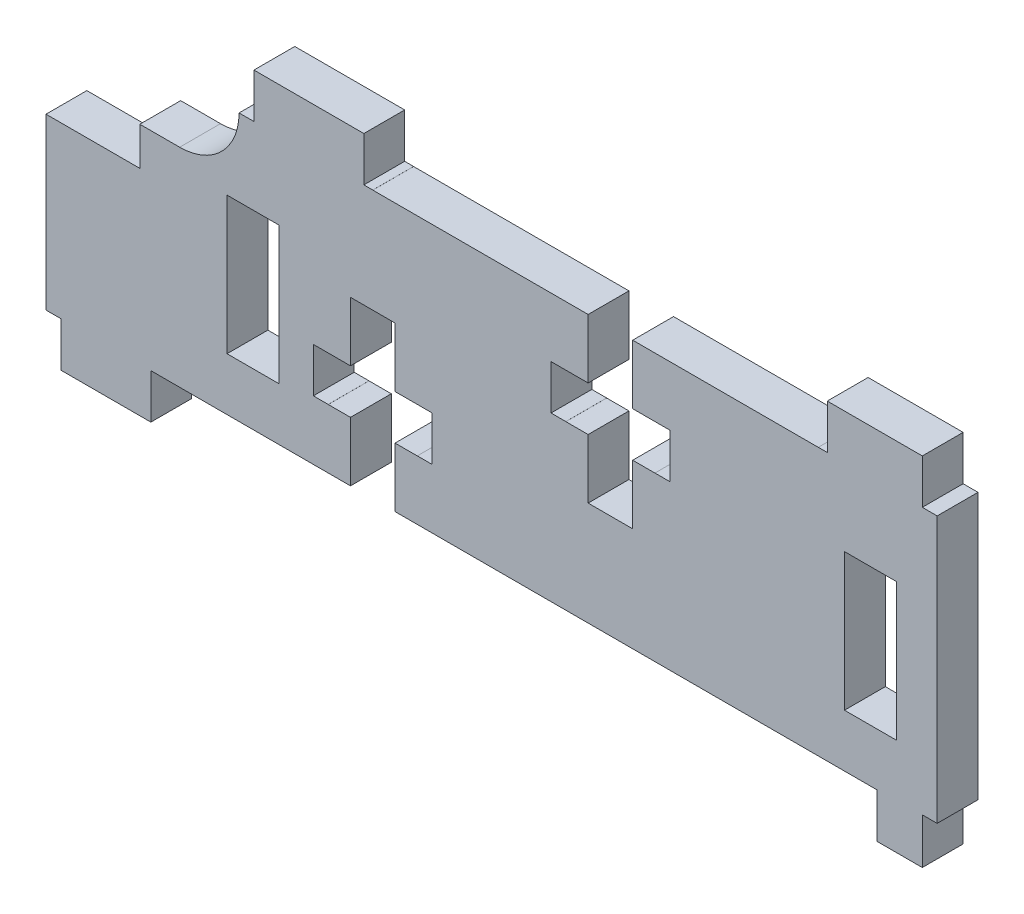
ISO-10303-21;
HEADER;
FILE_DESCRIPTION(('STEP AP214'),'2;1');
FILE_NAME('part.step','',(''),(''),'','','');
FILE_SCHEMA(('AUTOMOTIVE_DESIGN { 1 0 10303 214 1 1 1 1 }'));
ENDSEC;
DATA;
#1=APPLICATION_CONTEXT('core data for automotive mechanical design processes');
#2=APPLICATION_PROTOCOL_DEFINITION('international standard','automotive_design',2000,#1);
#3=PRODUCT_CONTEXT('',#1,'mechanical');
#4=PRODUCT('Part','Part','',(#3));
#5=PRODUCT_RELATED_PRODUCT_CATEGORY('part','',(#4));
#6=PRODUCT_DEFINITION_FORMATION('','',#4);
#7=PRODUCT_DEFINITION_CONTEXT('part definition',#1,'design');
#8=PRODUCT_DEFINITION('design','',#6,#7);
#9=PRODUCT_DEFINITION_SHAPE('','',#8);
#10=(LENGTH_UNIT() NAMED_UNIT(*) SI_UNIT(.MILLI.,.METRE.));
#11=(NAMED_UNIT(*) PLANE_ANGLE_UNIT() SI_UNIT($,.RADIAN.));
#12=(NAMED_UNIT(*) SI_UNIT($,.STERADIAN.) SOLID_ANGLE_UNIT());
#13=UNCERTAINTY_MEASURE_WITH_UNIT(LENGTH_MEASURE(1.E-05),#10,'distance_accuracy_value','');
#14=(GEOMETRIC_REPRESENTATION_CONTEXT(3) GLOBAL_UNCERTAINTY_ASSIGNED_CONTEXT((#13)) GLOBAL_UNIT_ASSIGNED_CONTEXT((#10,
#11,#12)) REPRESENTATION_CONTEXT('',''));
#15=CARTESIAN_POINT('',(0.,0.,0.));
#16=DIRECTION('',(0.,0.,1.));
#17=DIRECTION('',(1.,0.,0.));
#18=AXIS2_PLACEMENT_3D('',#15,#16,#17);
#19=CARTESIAN_POINT('',(-60.1403680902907,14.4465682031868,0.));
#20=DIRECTION('',(0.,0.,-1.));
#21=DIRECTION('',(-1.,0.,0.));
#22=AXIS2_PLACEMENT_3D('',#19,#20,#21);
#23=PLANE('',#22);
#24=DIRECTION('',(0.,1.,0.));
#25=VECTOR('',#24,1.);
#26=CARTESIAN_POINT('',(-15.3792001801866,14.4465682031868,0.));
#27=LINE('',#26,#25);
#28=CARTESIAN_POINT('',(-15.3792001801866,0.,0.));
#29=VERTEX_POINT('',#28);
#30=CARTESIAN_POINT('',(-15.3792001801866,9.25,0.));
#31=VERTEX_POINT('',#30);
#32=EDGE_CURVE('E489',#29,#31,#27,.T.);
#33=ORIENTED_EDGE('',*,*,#32,.F.);
#34=DIRECTION('',(-1.,0.,0.));
#35=VECTOR('',#34,1.);
#36=CARTESIAN_POINT('',(-60.1403680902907,0.,0.));
#37=LINE('',#36,#35);
#38=CARTESIAN_POINT('',(-11.8792001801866,0.,0.));
#39=VERTEX_POINT('',#38);
#40=EDGE_CURVE('E482',#39,#29,#37,.T.);
#41=ORIENTED_EDGE('',*,*,#40,.F.);
#42=DIRECTION('',(0.,-1.,0.));
#43=VECTOR('',#42,1.);
#44=CARTESIAN_POINT('',(-11.8792001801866,14.4465682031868,0.));
#45=LINE('',#44,#43);
#46=CARTESIAN_POINT('',(-11.8792001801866,9.25,0.));
#47=VERTEX_POINT('',#46);
#48=EDGE_CURVE('E462',#47,#39,#45,.T.);
#49=ORIENTED_EDGE('',*,*,#48,.F.);
#50=DIRECTION('',(1.,0.,0.));
#51=VECTOR('',#50,1.);
#52=CARTESIAN_POINT('',(-60.1403680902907,9.25,0.));
#53=LINE('',#52,#51);
#54=EDGE_CURVE('E487',#31,#47,#53,.T.);
#55=ORIENTED_EDGE('',*,*,#54,.F.);
#56=EDGE_LOOP('',(#33,#41,#49,#55));
#57=FACE_BOUND('',#56,.T.);
#58=DIRECTION('',(0.,1.,0.));
#59=VECTOR('',#58,1.);
#60=CARTESIAN_POINT('',(-56.951457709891,14.4465682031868,0.));
#61=LINE('',#60,#59);
#62=CARTESIAN_POINT('',(-56.951457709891,0.,0.));
#63=VERTEX_POINT('',#62);
#64=CARTESIAN_POINT('',(-56.951457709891,9.25,0.));
#65=VERTEX_POINT('',#64);
#66=EDGE_CURVE('E518',#63,#65,#61,.T.);
#67=ORIENTED_EDGE('',*,*,#66,.F.);
#68=DIRECTION('',(-1.,0.,0.));
#69=VECTOR('',#68,1.);
#70=CARTESIAN_POINT('',(-60.1403680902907,0.,0.));
#71=LINE('',#70,#69);
#72=CARTESIAN_POINT('',(-53.451457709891,0.,0.));
#73=VERTEX_POINT('',#72);
#74=EDGE_CURVE('E505',#73,#63,#71,.T.);
#75=ORIENTED_EDGE('',*,*,#74,.F.);
#76=DIRECTION('',(0.,-1.,0.));
#77=VECTOR('',#76,1.);
#78=CARTESIAN_POINT('',(-53.451457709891,14.4465682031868,0.));
#79=LINE('',#78,#77);
#80=CARTESIAN_POINT('',(-53.451457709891,9.25,0.));
#81=VERTEX_POINT('',#80);
#82=EDGE_CURVE('E513',#81,#73,#79,.T.);
#83=ORIENTED_EDGE('',*,*,#82,.F.);
#84=DIRECTION('',(1.,0.,0.));
#85=VECTOR('',#84,1.);
#86=CARTESIAN_POINT('',(-60.1403680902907,9.25,0.));
#87=LINE('',#86,#85);
#88=EDGE_CURVE('E516',#65,#81,#87,.T.);
#89=ORIENTED_EDGE('',*,*,#88,.F.);
#90=EDGE_LOOP('',(#67,#75,#83,#89));
#91=FACE_BOUND('',#90,.T.);
#92=DIRECTION('',(0.,-1.,0.));
#93=VECTOR('',#92,1.);
#94=CARTESIAN_POINT('',(-62.8233377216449,14.4465682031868,0.));
#95=LINE('',#94,#93);
#96=CARTESIAN_POINT('',(-62.8233377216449,10.4465682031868,0.));
#97=VERTEX_POINT('',#96);
#98=CARTESIAN_POINT('',(-62.8233377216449,7.87357799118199,0.));
#99=VERTEX_POINT('',#98);
#100=EDGE_CURVE('E534',#97,#99,#95,.T.);
#101=ORIENTED_EDGE('',*,*,#100,.F.);
#102=DIRECTION('',(-1.,0.,0.));
#103=VECTOR('',#102,1.);
#104=CARTESIAN_POINT('',(-60.1403680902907,10.4465682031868,0.));
#105=LINE('',#104,#103);
#106=CARTESIAN_POINT('',(-60.1403680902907,10.4465682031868,0.));
#107=VERTEX_POINT('',#106);
#108=EDGE_CURVE('E34',#97,#107,#105,.F.);
#109=ORIENTED_EDGE('',*,*,#108,.T.);
#110=CARTESIAN_POINT('',(-60.1403680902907,14.4465682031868,0.));
#111=DIRECTION('',(0.,0.,-1.));
#112=DIRECTION('',(-1.,0.,0.));
#113=AXIS2_PLACEMENT_3D('',#110,#111,#112);
#114=CIRCLE('',#113,4.);
#115=CARTESIAN_POINT('',(-56.1403680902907,14.4465682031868,0.));
#116=VERTEX_POINT('',#115);
#117=EDGE_CURVE('E916',#107,#116,#114,.F.);
#118=ORIENTED_EDGE('',*,*,#117,.T.);
#119=DIRECTION('',(1.,0.,0.));
#120=VECTOR('',#119,1.);
#121=CARTESIAN_POINT('',(-56.1403680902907,14.4465682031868,0.));
#122=LINE('',#121,#120);
#123=CARTESIAN_POINT('',(-55.1403680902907,14.4465682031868,0.));
#124=VERTEX_POINT('',#123);
#125=EDGE_CURVE('E764',#116,#124,#122,.T.);
#126=ORIENTED_EDGE('',*,*,#125,.T.);
#127=DIRECTION('',(0.,1.,0.));
#128=VECTOR('',#127,1.);
#129=CARTESIAN_POINT('',(-55.1403680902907,17.4465682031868,0.));
#130=LINE('',#129,#128);
#131=CARTESIAN_POINT('',(-55.1403680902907,17.4465682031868,0.));
#132=VERTEX_POINT('',#131);
#133=EDGE_CURVE('E767',#124,#132,#130,.T.);
#134=ORIENTED_EDGE('',*,*,#133,.T.);
#135=DIRECTION('',(-1.,0.,0.));
#136=VECTOR('',#135,1.);
#137=CARTESIAN_POINT('',(-60.1403680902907,17.4465682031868,0.));
#138=LINE('',#137,#136);
#139=CARTESIAN_POINT('',(-47.74,17.4465682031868,0.));
#140=VERTEX_POINT('',#139);
#141=EDGE_CURVE('E867',#132,#140,#138,.F.);
#142=ORIENTED_EDGE('',*,*,#141,.T.);
#143=DIRECTION('',(0.,-1.,0.));
#144=VECTOR('',#143,1.);
#145=CARTESIAN_POINT('',(-47.74,17.45,0.));
#146=LINE('',#145,#144);
#147=CARTESIAN_POINT('',(-47.74,14.45,0.));
#148=VERTEX_POINT('',#147);
#149=EDGE_CURVE('E774',#140,#148,#146,.T.);
#150=ORIENTED_EDGE('',*,*,#149,.T.);
#151=DIRECTION('',(1.,0.,0.));
#152=VECTOR('',#151,1.);
#153=CARTESIAN_POINT('',(-47.74,14.45,0.));
#154=LINE('',#153,#152);
#155=CARTESIAN_POINT('',(-47.1403680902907,14.45,0.));
#156=VERTEX_POINT('',#155);
#157=EDGE_CURVE('E778',#148,#156,#154,.T.);
#158=ORIENTED_EDGE('',*,*,#157,.T.);
#159=DIRECTION('',(0.,1.,0.));
#160=VECTOR('',#159,1.);
#161=CARTESIAN_POINT('',(-47.1403680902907,14.4465682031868,0.));
#162=LINE('',#161,#160);
#163=CARTESIAN_POINT('',(-47.1403680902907,14.4465682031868,0.));
#164=VERTEX_POINT('',#163);
#165=EDGE_CURVE('E865',#156,#164,#162,.F.);
#166=ORIENTED_EDGE('',*,*,#165,.T.);
#167=DIRECTION('',(-1.,0.,0.));
#168=VECTOR('',#167,1.);
#169=CARTESIAN_POINT('',(-60.1403680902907,14.4465682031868,0.));
#170=LINE('',#169,#168);
#171=CARTESIAN_POINT('',(-32.6403680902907,14.4465682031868,0.));
#172=VERTEX_POINT('',#171);
#173=EDGE_CURVE('E862',#164,#172,#170,.F.);
#174=ORIENTED_EDGE('',*,*,#173,.T.);
#175=DIRECTION('',(0.,1.,0.));
#176=VECTOR('',#175,1.);
#177=CARTESIAN_POINT('',(-32.6403680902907,14.4465682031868,0.));
#178=LINE('',#177,#176);
#179=CARTESIAN_POINT('',(-32.6403680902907,10.45,0.));
#180=VERTEX_POINT('',#179);
#181=EDGE_CURVE('E859',#172,#180,#178,.F.);
#182=ORIENTED_EDGE('',*,*,#181,.T.);
#183=DIRECTION('',(-1.,0.,0.));
#184=VECTOR('',#183,1.);
#185=CARTESIAN_POINT('',(-35.14,10.45,0.));
#186=LINE('',#185,#184);
#187=CARTESIAN_POINT('',(-35.14,10.45,0.));
#188=VERTEX_POINT('',#187);
#189=EDGE_CURVE('E684',#180,#188,#186,.T.);
#190=ORIENTED_EDGE('',*,*,#189,.T.);
#191=DIRECTION('',(0.,-1.,0.));
#192=VECTOR('',#191,1.);
#193=CARTESIAN_POINT('',(-35.14,10.45,0.));
#194=LINE('',#193,#192);
#195=CARTESIAN_POINT('',(-35.14,7.45,0.));
#196=VERTEX_POINT('',#195);
#197=EDGE_CURVE('E674',#188,#196,#194,.T.);
#198=ORIENTED_EDGE('',*,*,#197,.T.);
#199=DIRECTION('',(1.,0.,0.));
#200=VECTOR('',#199,1.);
#201=CARTESIAN_POINT('',(-35.14,7.45,0.));
#202=LINE('',#201,#200);
#203=CARTESIAN_POINT('',(-34.1403680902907,7.45,0.));
#204=VERTEX_POINT('',#203);
#205=EDGE_CURVE('E678',#196,#204,#202,.T.);
#206=ORIENTED_EDGE('',*,*,#205,.T.);
#207=DIRECTION('',(0.,1.,0.));
#208=VECTOR('',#207,1.);
#209=CARTESIAN_POINT('',(-34.1403680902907,14.4465682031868,0.));
#210=LINE('',#209,#208);
#211=CARTESIAN_POINT('',(-34.1403680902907,7.44656820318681,0.));
#212=VERTEX_POINT('',#211);
#213=EDGE_CURVE('E857',#204,#212,#210,.F.);
#214=ORIENTED_EDGE('',*,*,#213,.T.);
#215=DIRECTION('',(1.,0.,0.));
#216=VECTOR('',#215,1.);
#217=CARTESIAN_POINT('',(-34.1403680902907,7.44656820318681,0.));
#218=LINE('',#217,#216);
#219=CARTESIAN_POINT('',(-32.6403680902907,7.44656820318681,0.));
#220=VERTEX_POINT('',#219);
#221=EDGE_CURVE('E810',#212,#220,#218,.T.);
#222=ORIENTED_EDGE('',*,*,#221,.T.);
#223=DIRECTION('',(0.,1.,0.));
#224=VECTOR('',#223,1.);
#225=CARTESIAN_POINT('',(-32.6403680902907,14.4465682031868,0.));
#226=LINE('',#225,#224);
#227=CARTESIAN_POINT('',(-32.6403680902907,3.44656820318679,0.));
#228=VERTEX_POINT('',#227);
#229=EDGE_CURVE('E854',#220,#228,#226,.F.);
#230=ORIENTED_EDGE('',*,*,#229,.T.);
#231=DIRECTION('',(-1.,0.,0.));
#232=VECTOR('',#231,1.);
#233=CARTESIAN_POINT('',(-60.1403680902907,3.44656820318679,0.));
#234=LINE('',#233,#232);
#235=CARTESIAN_POINT('',(-29.6403680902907,3.44656820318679,0.));
#236=VERTEX_POINT('',#235);
#237=EDGE_CURVE('E851',#228,#236,#234,.F.);
#238=ORIENTED_EDGE('',*,*,#237,.T.);
#239=DIRECTION('',(0.,1.,0.));
#240=VECTOR('',#239,1.);
#241=CARTESIAN_POINT('',(-29.6403680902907,14.4465682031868,0.));
#242=LINE('',#241,#240);
#243=CARTESIAN_POINT('',(-29.6403680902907,7.44656820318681,0.));
#244=VERTEX_POINT('',#243);
#245=EDGE_CURVE('E848',#236,#244,#242,.T.);
#246=ORIENTED_EDGE('',*,*,#245,.T.);
#247=DIRECTION('',(1.,0.,0.));
#248=VECTOR('',#247,1.);
#249=CARTESIAN_POINT('',(-29.6403680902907,7.44656820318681,0.));
#250=LINE('',#249,#248);
#251=CARTESIAN_POINT('',(-28.1403680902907,7.44656820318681,0.));
#252=VERTEX_POINT('',#251);
#253=EDGE_CURVE('E977',#244,#252,#250,.T.);
#254=ORIENTED_EDGE('',*,*,#253,.T.);
#255=DIRECTION('',(0.,1.,0.));
#256=VECTOR('',#255,1.);
#257=CARTESIAN_POINT('',(-28.1403680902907,14.4465682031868,0.));
#258=LINE('',#257,#256);
#259=CARTESIAN_POINT('',(-28.1403680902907,7.45,0.));
#260=VERTEX_POINT('',#259);
#261=EDGE_CURVE('E845',#252,#260,#258,.T.);
#262=ORIENTED_EDGE('',*,*,#261,.T.);
#263=CARTESIAN_POINT('',(-27.14,7.45,0.));
#264=VERTEX_POINT('',#263);
#265=EDGE_CURVE('E677',#260,#264,#202,.T.);
#266=ORIENTED_EDGE('',*,*,#265,.T.);
#267=DIRECTION('',(0.,1.,0.));
#268=VECTOR('',#267,1.);
#269=CARTESIAN_POINT('',(-27.14,10.45,0.));
#270=LINE('',#269,#268);
#271=CARTESIAN_POINT('',(-27.14,10.45,0.));
#272=VERTEX_POINT('',#271);
#273=EDGE_CURVE('E681',#264,#272,#270,.T.);
#274=ORIENTED_EDGE('',*,*,#273,.T.);
#275=CARTESIAN_POINT('',(-29.6403680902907,10.45,0.));
#276=VERTEX_POINT('',#275);
#277=EDGE_CURVE('E685',#272,#276,#186,.T.);
#278=ORIENTED_EDGE('',*,*,#277,.T.);
#279=DIRECTION('',(0.,1.,0.));
#280=VECTOR('',#279,1.);
#281=CARTESIAN_POINT('',(-29.6403680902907,14.4465682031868,0.));
#282=LINE('',#281,#280);
#283=CARTESIAN_POINT('',(-29.6403680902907,14.4465682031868,0.));
#284=VERTEX_POINT('',#283);
#285=EDGE_CURVE('E842',#276,#284,#282,.T.);
#286=ORIENTED_EDGE('',*,*,#285,.T.);
#287=DIRECTION('',(-1.,0.,0.));
#288=VECTOR('',#287,1.);
#289=CARTESIAN_POINT('',(-60.1403680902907,14.4465682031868,0.));
#290=LINE('',#289,#288);
#291=CARTESIAN_POINT('',(-17.1403680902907,14.4465682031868,0.));
#292=VERTEX_POINT('',#291);
#293=EDGE_CURVE('E839',#284,#292,#290,.F.);
#294=ORIENTED_EDGE('',*,*,#293,.T.);
#295=DIRECTION('',(0.,1.,0.));
#296=VECTOR('',#295,1.);
#297=CARTESIAN_POINT('',(-17.1403680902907,14.4465682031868,0.));
#298=LINE('',#297,#296);
#299=CARTESIAN_POINT('',(-17.1403680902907,14.45,0.));
#300=VERTEX_POINT('',#299);
#301=EDGE_CURVE('E836',#292,#300,#298,.T.);
#302=ORIENTED_EDGE('',*,*,#301,.T.);
#303=CARTESIAN_POINT('',(-16.54,14.45,0.));
#304=VERTEX_POINT('',#303);
#305=EDGE_CURVE('E777',#300,#304,#154,.T.);
#306=ORIENTED_EDGE('',*,*,#305,.T.);
#307=DIRECTION('',(0.,1.,0.));
#308=VECTOR('',#307,1.);
#309=CARTESIAN_POINT('',(-16.54,17.45,0.));
#310=LINE('',#309,#308);
#311=CARTESIAN_POINT('',(-16.54,17.4465682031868,0.));
#312=VERTEX_POINT('',#311);
#313=EDGE_CURVE('E781',#304,#312,#310,.T.);
#314=ORIENTED_EDGE('',*,*,#313,.T.);
#315=DIRECTION('',(-1.,0.,0.));
#316=VECTOR('',#315,1.);
#317=CARTESIAN_POINT('',(-60.1403680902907,17.4465682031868,0.));
#318=LINE('',#317,#316);
#319=CARTESIAN_POINT('',(-10.1403680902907,17.4465682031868,0.));
#320=VERTEX_POINT('',#319);
#321=EDGE_CURVE('E833',#312,#320,#318,.F.);
#322=ORIENTED_EDGE('',*,*,#321,.T.);
#323=DIRECTION('',(0.,-1.,0.));
#324=VECTOR('',#323,1.);
#325=CARTESIAN_POINT('',(-10.1403680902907,17.4465682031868,0.));
#326=LINE('',#325,#324);
#327=CARTESIAN_POINT('',(-10.1403680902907,14.4499916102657,0.));
#328=VERTEX_POINT('',#327);
#329=EDGE_CURVE('E752',#320,#328,#326,.T.);
#330=ORIENTED_EDGE('',*,*,#329,.T.);
#331=DIRECTION('',(1.,0.,0.));
#332=VECTOR('',#331,1.);
#333=CARTESIAN_POINT('',(-9.14036809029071,14.4499916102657,0.));
#334=LINE('',#333,#332);
#335=CARTESIAN_POINT('',(-9.14036809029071,14.4499916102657,0.));
#336=VERTEX_POINT('',#335);
#337=EDGE_CURVE('E755',#328,#336,#334,.T.);
#338=ORIENTED_EDGE('',*,*,#337,.T.);
#339=DIRECTION('',(0.,1.,0.));
#340=VECTOR('',#339,1.);
#341=CARTESIAN_POINT('',(-9.14036809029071,14.4465682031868,0.));
#342=LINE('',#341,#340);
#343=CARTESIAN_POINT('',(-9.14036809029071,-3.47856456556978,0.));
#344=VERTEX_POINT('',#343);
#345=EDGE_CURVE('E830',#336,#344,#342,.F.);
#346=ORIENTED_EDGE('',*,*,#345,.T.);
#347=DIRECTION('',(-1.,0.,0.));
#348=VECTOR('',#347,1.);
#349=CARTESIAN_POINT('',(-9.14036809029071,-3.47856456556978,0.));
#350=LINE('',#349,#348);
#351=CARTESIAN_POINT('',(-10.1403680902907,-3.47856456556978,0.));
#352=VERTEX_POINT('',#351);
#353=EDGE_CURVE('E740',#344,#352,#350,.T.);
#354=ORIENTED_EDGE('',*,*,#353,.T.);
#355=DIRECTION('',(0.,-1.,0.));
#356=VECTOR('',#355,1.);
#357=CARTESIAN_POINT('',(-10.1403680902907,-6.55343179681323,0.));
#358=LINE('',#357,#356);
#359=CARTESIAN_POINT('',(-10.1403680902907,-6.55343179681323,0.));
#360=VERTEX_POINT('',#359);
#361=EDGE_CURVE('E743',#352,#360,#358,.T.);
#362=ORIENTED_EDGE('',*,*,#361,.T.);
#363=DIRECTION('',(-1.,0.,0.));
#364=VECTOR('',#363,1.);
#365=CARTESIAN_POINT('',(-60.1403680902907,-6.55343179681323,0.));
#366=LINE('',#365,#364);
#367=CARTESIAN_POINT('',(-13.2,-6.55343179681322,0.));
#368=VERTEX_POINT('',#367);
#369=EDGE_CURVE('E828',#360,#368,#366,.T.);
#370=ORIENTED_EDGE('',*,*,#369,.T.);
#371=DIRECTION('',(0.,1.,0.));
#372=VECTOR('',#371,1.);
#373=CARTESIAN_POINT('',(-13.2,14.4465682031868,0.));
#374=LINE('',#373,#372);
#375=CARTESIAN_POINT('',(-13.2,-3.55,0.));
#376=VERTEX_POINT('',#375);
#377=EDGE_CURVE('E937',#368,#376,#374,.T.);
#378=ORIENTED_EDGE('',*,*,#377,.T.);
#379=DIRECTION('',(-1.,0.,0.));
#380=VECTOR('',#379,1.);
#381=CARTESIAN_POINT('',(-62.08,-3.55,0.));
#382=LINE('',#381,#380);
#383=CARTESIAN_POINT('',(-45.6403680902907,-3.55,0.));
#384=VERTEX_POINT('',#383);
#385=EDGE_CURVE('E793',#376,#384,#382,.T.);
#386=ORIENTED_EDGE('',*,*,#385,.T.);
#387=DIRECTION('',(0.,1.,0.));
#388=VECTOR('',#387,1.);
#389=CARTESIAN_POINT('',(-45.6403680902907,14.4465682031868,0.));
#390=LINE('',#389,#388);
#391=CARTESIAN_POINT('',(-45.6403680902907,0.446568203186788,0.));
#392=VERTEX_POINT('',#391);
#393=EDGE_CURVE('E826',#384,#392,#390,.T.);
#394=ORIENTED_EDGE('',*,*,#393,.T.);
#395=DIRECTION('',(1.,0.,0.));
#396=VECTOR('',#395,1.);
#397=CARTESIAN_POINT('',(-45.6403680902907,0.446568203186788,0.));
#398=LINE('',#397,#396);
#399=CARTESIAN_POINT('',(-44.1403680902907,0.446568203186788,0.));
#400=VERTEX_POINT('',#399);
#401=EDGE_CURVE('E981',#392,#400,#398,.T.);
#402=ORIENTED_EDGE('',*,*,#401,.T.);
#403=DIRECTION('',(0.,1.,0.));
#404=VECTOR('',#403,1.);
#405=CARTESIAN_POINT('',(-44.1403680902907,14.4465682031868,0.));
#406=LINE('',#405,#404);
#407=CARTESIAN_POINT('',(-44.1403680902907,0.45,0.));
#408=VERTEX_POINT('',#407);
#409=EDGE_CURVE('E823',#400,#408,#406,.T.);
#410=ORIENTED_EDGE('',*,*,#409,.T.);
#411=DIRECTION('',(1.,0.,0.));
#412=VECTOR('',#411,1.);
#413=CARTESIAN_POINT('',(-51.14,0.45,0.));
#414=LINE('',#413,#412);
#415=CARTESIAN_POINT('',(-43.14,0.45,0.));
#416=VERTEX_POINT('',#415);
#417=EDGE_CURVE('E704',#408,#416,#414,.T.);
#418=ORIENTED_EDGE('',*,*,#417,.T.);
#419=DIRECTION('',(0.,1.,0.));
#420=VECTOR('',#419,1.);
#421=CARTESIAN_POINT('',(-43.14,3.45,0.));
#422=LINE('',#421,#420);
#423=CARTESIAN_POINT('',(-43.14,3.45,0.));
#424=VERTEX_POINT('',#423);
#425=EDGE_CURVE('E708',#416,#424,#422,.T.);
#426=ORIENTED_EDGE('',*,*,#425,.T.);
#427=DIRECTION('',(-1.,0.,0.));
#428=VECTOR('',#427,1.);
#429=CARTESIAN_POINT('',(-51.14,3.45,0.));
#430=LINE('',#429,#428);
#431=CARTESIAN_POINT('',(-45.6403680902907,3.45,0.));
#432=VERTEX_POINT('',#431);
#433=EDGE_CURVE('E712',#424,#432,#430,.T.);
#434=ORIENTED_EDGE('',*,*,#433,.T.);
#435=DIRECTION('',(0.,1.,0.));
#436=VECTOR('',#435,1.);
#437=CARTESIAN_POINT('',(-45.6403680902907,14.4465682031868,0.));
#438=LINE('',#437,#436);
#439=CARTESIAN_POINT('',(-45.6403680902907,7.44656820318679,0.));
#440=VERTEX_POINT('',#439);
#441=EDGE_CURVE('E820',#432,#440,#438,.T.);
#442=ORIENTED_EDGE('',*,*,#441,.T.);
#443=DIRECTION('',(-1.,0.,0.));
#444=VECTOR('',#443,1.);
#445=CARTESIAN_POINT('',(-60.1403680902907,7.44656820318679,0.));
#446=LINE('',#445,#444);
#447=CARTESIAN_POINT('',(-48.6403680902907,7.44656820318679,0.));
#448=VERTEX_POINT('',#447);
#449=EDGE_CURVE('E817',#440,#448,#446,.T.);
#450=ORIENTED_EDGE('',*,*,#449,.T.);
#451=DIRECTION('',(0.,1.,0.));
#452=VECTOR('',#451,1.);
#453=CARTESIAN_POINT('',(-48.6403680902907,14.4465682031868,0.));
#454=LINE('',#453,#452);
#455=CARTESIAN_POINT('',(-48.6403680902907,3.45,0.));
#456=VERTEX_POINT('',#455);
#457=EDGE_CURVE('E814',#448,#456,#454,.F.);
#458=ORIENTED_EDGE('',*,*,#457,.T.);
#459=CARTESIAN_POINT('',(-51.14,3.45,0.));
#460=VERTEX_POINT('',#459);
#461=EDGE_CURVE('E711',#456,#460,#430,.T.);
#462=ORIENTED_EDGE('',*,*,#461,.T.);
#463=DIRECTION('',(0.,-1.,0.));
#464=VECTOR('',#463,1.);
#465=CARTESIAN_POINT('',(-51.14,3.45,0.));
#466=LINE('',#465,#464);
#467=CARTESIAN_POINT('',(-51.14,0.45,0.));
#468=VERTEX_POINT('',#467);
#469=EDGE_CURVE('E701',#460,#468,#466,.T.);
#470=ORIENTED_EDGE('',*,*,#469,.T.);
#471=CARTESIAN_POINT('',(-50.1403680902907,0.45,0.));
#472=VERTEX_POINT('',#471);
#473=EDGE_CURVE('E705',#468,#472,#414,.T.);
#474=ORIENTED_EDGE('',*,*,#473,.T.);
#475=DIRECTION('',(0.,1.,0.));
#476=VECTOR('',#475,1.);
#477=CARTESIAN_POINT('',(-50.1403680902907,14.4465682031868,0.));
#478=LINE('',#477,#476);
#479=CARTESIAN_POINT('',(-50.1403680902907,0.446568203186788,0.));
#480=VERTEX_POINT('',#479);
#481=EDGE_CURVE('E811',#472,#480,#478,.F.);
#482=ORIENTED_EDGE('',*,*,#481,.T.);
#483=DIRECTION('',(1.,0.,0.));
#484=VECTOR('',#483,1.);
#485=CARTESIAN_POINT('',(-50.1403680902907,0.446568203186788,0.));
#486=LINE('',#485,#484);
#487=CARTESIAN_POINT('',(-48.6403680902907,0.446568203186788,0.));
#488=VERTEX_POINT('',#487);
#489=EDGE_CURVE('E984',#480,#488,#486,.T.);
#490=ORIENTED_EDGE('',*,*,#489,.T.);
#491=DIRECTION('',(0.,1.,0.));
#492=VECTOR('',#491,1.);
#493=CARTESIAN_POINT('',(-48.6403680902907,14.4465682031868,0.));
#494=LINE('',#493,#492);
#495=CARTESIAN_POINT('',(-48.6403680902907,-3.55,0.));
#496=VERTEX_POINT('',#495);
#497=EDGE_CURVE('E813',#488,#496,#494,.F.);
#498=ORIENTED_EDGE('',*,*,#497,.T.);
#499=DIRECTION('',(-1.,0.,0.));
#500=VECTOR('',#499,1.);
#501=CARTESIAN_POINT('',(-60.1403680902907,-3.55,0.));
#502=LINE('',#501,#500);
#503=CARTESIAN_POINT('',(-62.08,-3.55,0.));
#504=VERTEX_POINT('',#503);
#505=EDGE_CURVE('E934',#496,#504,#502,.T.);
#506=ORIENTED_EDGE('',*,*,#505,.T.);
#507=DIRECTION('',(0.,-1.,0.));
#508=VECTOR('',#507,1.);
#509=CARTESIAN_POINT('',(-62.08,-3.55,0.));
#510=LINE('',#509,#508);
#511=CARTESIAN_POINT('',(-62.08,-6.55343179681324,0.));
#512=VERTEX_POINT('',#511);
#513=EDGE_CURVE('E790',#504,#512,#510,.T.);
#514=ORIENTED_EDGE('',*,*,#513,.T.);
#515=DIRECTION('',(-1.,0.,0.));
#516=VECTOR('',#515,1.);
#517=CARTESIAN_POINT('',(-60.1403680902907,-6.55343179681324,0.));
#518=LINE('',#517,#516);
#519=CARTESIAN_POINT('',(-68.1403680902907,-6.55343179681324,0.));
#520=VERTEX_POINT('',#519);
#521=EDGE_CURVE('E872',#512,#520,#518,.T.);
#522=ORIENTED_EDGE('',*,*,#521,.T.);
#523=DIRECTION('',(0.,1.,0.));
#524=VECTOR('',#523,1.);
#525=CARTESIAN_POINT('',(-68.1403680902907,-6.55343179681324,0.));
#526=LINE('',#525,#524);
#527=CARTESIAN_POINT('',(-68.1403680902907,-3.55,0.));
#528=VERTEX_POINT('',#527);
#529=EDGE_CURVE('E728',#520,#528,#526,.T.);
#530=ORIENTED_EDGE('',*,*,#529,.T.);
#531=DIRECTION('',(-1.,0.,0.));
#532=VECTOR('',#531,1.);
#533=CARTESIAN_POINT('',(-69.1403680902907,-3.55,0.));
#534=LINE('',#533,#532);
#535=CARTESIAN_POINT('',(-69.1403680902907,-3.55,0.));
#536=VERTEX_POINT('',#535);
#537=EDGE_CURVE('E731',#528,#536,#534,.T.);
#538=ORIENTED_EDGE('',*,*,#537,.T.);
#539=DIRECTION('',(0.,1.,0.));
#540=VECTOR('',#539,1.);
#541=CARTESIAN_POINT('',(-69.1403680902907,14.4465682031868,0.));
#542=LINE('',#541,#540);
#543=CARTESIAN_POINT('',(-69.1403680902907,7.87357799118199,0.));
#544=VERTEX_POINT('',#543);
#545=EDGE_CURVE('E919',#536,#544,#542,.T.);
#546=ORIENTED_EDGE('',*,*,#545,.T.);
#547=DIRECTION('',(-1.,0.,0.));
#548=VECTOR('',#547,1.);
#549=CARTESIAN_POINT('',(-60.1403680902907,7.87357799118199,0.));
#550=LINE('',#549,#548);
#551=EDGE_CURVE('E529',#99,#544,#550,.T.);
#552=ORIENTED_EDGE('',*,*,#551,.F.);
#553=EDGE_LOOP('',(#101,#109,#118,#126,#134,#142,#150,#158,#166,#174,#182,#190,#198,#206,#214,
#222,#230,#238,#246,#254,#262,#266,#274,#278,#286,#294,#302,#306,#314,#322,#330,#338,#346,#354,
#362,#370,#378,#386,#394,#402,#410,#418,#426,#434,#442,#450,#458,#462,#470,#474,#482,#490,#498,
#506,#514,#522,#530,#538,#546,#552));
#554=FACE_BOUND('',#553,.T.);
#555=ADVANCED_FACE('F30',(#57,#91,#554),#23,.T.);
#556=CARTESIAN_POINT('',(-32.6403680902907,14.4465682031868,3.));
#557=DIRECTION('',(-1.,0.,0.));
#558=DIRECTION('',(0.,-1.,0.));
#559=AXIS2_PLACEMENT_3D('',#556,#557,#558);
#560=PLANE('',#559);
#561=DIRECTION('',(0.,0.,1.));
#562=VECTOR('',#561,1.);
#563=CARTESIAN_POINT('',(-32.6403680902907,14.4465682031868,3.));
#564=LINE('',#563,#562);
#565=CARTESIAN_POINT('',(-32.6403680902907,14.4465682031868,2.75));
#566=VERTEX_POINT('',#565);
#567=EDGE_CURVE('E903',#566,#172,#564,.F.);
#568=ORIENTED_EDGE('',*,*,#567,.F.);
#569=DIRECTION('',(0.,-1.,0.));
#570=VECTOR('',#569,1.);
#571=CARTESIAN_POINT('',(-32.6403680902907,14.4465682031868,2.75));
#572=LINE('',#571,#570);
#573=CARTESIAN_POINT('',(-32.6403680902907,10.45,2.75));
#574=VERTEX_POINT('',#573);
#575=EDGE_CURVE('E550',#566,#574,#572,.T.);
#576=ORIENTED_EDGE('',*,*,#575,.T.);
#577=DIRECTION('',(0.,0.,1.));
#578=VECTOR('',#577,1.);
#579=CARTESIAN_POINT('',(-32.6403680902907,10.45,3.));
#580=LINE('',#579,#578);
#581=EDGE_CURVE('E696',#180,#574,#580,.T.);
#582=ORIENTED_EDGE('',*,*,#581,.F.);
#583=ORIENTED_EDGE('',*,*,#181,.F.);
#584=EDGE_LOOP('',(#568,#576,#582,#583));
#585=FACE_BOUND('',#584,.T.);
#586=ADVANCED_FACE('F1042',(#585),#560,.F.);
#587=CARTESIAN_POINT('',(-34.1403680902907,10.4465682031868,3.));
#588=DIRECTION('',(-1.,0.,0.));
#589=DIRECTION('',(0.,-1.,0.));
#590=AXIS2_PLACEMENT_3D('',#587,#588,#589);
#591=PLANE('',#590);
#592=DIRECTION('',(0.,0.,-1.));
#593=VECTOR('',#592,1.);
#594=CARTESIAN_POINT('',(-34.1403680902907,7.45,3.));
#595=LINE('',#594,#593);
#596=CARTESIAN_POINT('',(-34.1403680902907,7.45,2.75));
#597=VERTEX_POINT('',#596);
#598=EDGE_CURVE('E699',#597,#204,#595,.T.);
#599=ORIENTED_EDGE('',*,*,#598,.F.);
#600=DIRECTION('',(0.,-1.,0.));
#601=VECTOR('',#600,1.);
#602=CARTESIAN_POINT('',(-34.1403680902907,10.4465682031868,2.75));
#603=LINE('',#602,#601);
#604=CARTESIAN_POINT('',(-34.1403680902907,7.44656820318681,2.75));
#605=VERTEX_POINT('',#604);
#606=EDGE_CURVE('E547',#597,#605,#603,.T.);
#607=ORIENTED_EDGE('',*,*,#606,.T.);
#608=DIRECTION('',(0.,0.,1.));
#609=VECTOR('',#608,1.);
#610=CARTESIAN_POINT('',(-34.1403680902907,7.44656820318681,3.));
#611=LINE('',#610,#609);
#612=EDGE_CURVE('E900',#212,#605,#611,.T.);
#613=ORIENTED_EDGE('',*,*,#612,.F.);
#614=ORIENTED_EDGE('',*,*,#213,.F.);
#615=EDGE_LOOP('',(#599,#607,#613,#614));
#616=FACE_BOUND('',#615,.T.);
#617=ADVANCED_FACE('F1048',(#616),#591,.F.);
#618=CARTESIAN_POINT('',(-28.1403680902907,10.4465682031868,3.));
#619=DIRECTION('',(1.,0.,0.));
#620=DIRECTION('',(0.,0.,-1.));
#621=AXIS2_PLACEMENT_3D('',#618,#619,#620);
#622=PLANE('',#621);
#623=DIRECTION('',(0.,0.,-1.));
#624=VECTOR('',#623,1.);
#625=CARTESIAN_POINT('',(-28.1403680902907,7.44656820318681,3.));
#626=LINE('',#625,#624);
#627=CARTESIAN_POINT('',(-28.1403680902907,7.44656820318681,2.75));
#628=VERTEX_POINT('',#627);
#629=EDGE_CURVE('E889',#628,#252,#626,.T.);
#630=ORIENTED_EDGE('',*,*,#629,.F.);
#631=DIRECTION('',(0.,1.,0.));
#632=VECTOR('',#631,1.);
#633=CARTESIAN_POINT('',(-28.1403680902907,10.4465682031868,2.75));
#634=LINE('',#633,#632);
#635=CARTESIAN_POINT('',(-28.1403680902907,7.45,2.75));
#636=VERTEX_POINT('',#635);
#637=EDGE_CURVE('E578',#628,#636,#634,.T.);
#638=ORIENTED_EDGE('',*,*,#637,.T.);
#639=DIRECTION('',(0.,0.,1.));
#640=VECTOR('',#639,1.);
#641=CARTESIAN_POINT('',(-28.1403680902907,7.45,3.));
#642=LINE('',#641,#640);
#643=EDGE_CURVE('E40',#260,#636,#642,.T.);
#644=ORIENTED_EDGE('',*,*,#643,.F.);
#645=ORIENTED_EDGE('',*,*,#261,.F.);
#646=EDGE_LOOP('',(#630,#638,#644,#645));
#647=FACE_BOUND('',#646,.T.);
#648=ADVANCED_FACE('F973',(#647),#622,.F.);
#649=CARTESIAN_POINT('',(-29.6403680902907,14.4465682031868,3.));
#650=DIRECTION('',(1.,0.,0.));
#651=DIRECTION('',(0.,0.,-1.));
#652=AXIS2_PLACEMENT_3D('',#649,#650,#651);
#653=PLANE('',#652);
#654=DIRECTION('',(0.,0.,-1.));
#655=VECTOR('',#654,1.);
#656=CARTESIAN_POINT('',(-29.6403680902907,10.45,3.));
#657=LINE('',#656,#655);
#658=CARTESIAN_POINT('',(-29.6403680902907,10.45,2.75));
#659=VERTEX_POINT('',#658);
#660=EDGE_CURVE('E957',#659,#276,#657,.T.);
#661=ORIENTED_EDGE('',*,*,#660,.F.);
#662=DIRECTION('',(0.,1.,0.));
#663=VECTOR('',#662,1.);
#664=CARTESIAN_POINT('',(-29.6403680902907,14.4465682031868,2.75));
#665=LINE('',#664,#663);
#666=CARTESIAN_POINT('',(-29.6403680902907,14.4465682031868,2.75));
#667=VERTEX_POINT('',#666);
#668=EDGE_CURVE('E587',#659,#667,#665,.T.);
#669=ORIENTED_EDGE('',*,*,#668,.T.);
#670=DIRECTION('',(0.,0.,1.));
#671=VECTOR('',#670,1.);
#672=CARTESIAN_POINT('',(-29.6403680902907,14.4465682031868,3.));
#673=LINE('',#672,#671);
#674=EDGE_CURVE('E887',#667,#284,#673,.F.);
#675=ORIENTED_EDGE('',*,*,#674,.T.);
#676=ORIENTED_EDGE('',*,*,#285,.F.);
#677=EDGE_LOOP('',(#661,#669,#675,#676));
#678=FACE_BOUND('',#677,.T.);
#679=ADVANCED_FACE('F1084',(#678),#653,.F.);
#680=CARTESIAN_POINT('',(-44.1403680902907,3.44656820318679,3.));
#681=DIRECTION('',(1.,0.,0.));
#682=DIRECTION('',(0.,0.,-1.));
#683=AXIS2_PLACEMENT_3D('',#680,#681,#682);
#684=PLANE('',#683);
#685=DIRECTION('',(0.,0.,-1.));
#686=VECTOR('',#685,1.);
#687=CARTESIAN_POINT('',(-44.1403680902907,0.446568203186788,3.));
#688=LINE('',#687,#686);
#689=CARTESIAN_POINT('',(-44.1403680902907,0.446568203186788,2.75));
#690=VERTEX_POINT('',#689);
#691=EDGE_CURVE('E880',#690,#400,#688,.T.);
#692=ORIENTED_EDGE('',*,*,#691,.F.);
#693=DIRECTION('',(0.,1.,0.));
#694=VECTOR('',#693,1.);
#695=CARTESIAN_POINT('',(-44.1403680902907,3.44656820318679,2.75));
#696=LINE('',#695,#694);
#697=CARTESIAN_POINT('',(-44.1403680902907,0.45,2.75));
#698=VERTEX_POINT('',#697);
#699=EDGE_CURVE('E609',#690,#698,#696,.T.);
#700=ORIENTED_EDGE('',*,*,#699,.T.);
#701=DIRECTION('',(0.,0.,1.));
#702=VECTOR('',#701,1.);
#703=CARTESIAN_POINT('',(-44.1403680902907,0.45,3.));
#704=LINE('',#703,#702);
#705=EDGE_CURVE('E723',#408,#698,#704,.T.);
#706=ORIENTED_EDGE('',*,*,#705,.F.);
#707=ORIENTED_EDGE('',*,*,#409,.F.);
#708=EDGE_LOOP('',(#692,#700,#706,#707));
#709=FACE_BOUND('',#708,.T.);
#710=ADVANCED_FACE('F1080',(#709),#684,.F.);
#711=CARTESIAN_POINT('',(-45.6403680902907,3.44656820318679,3.));
#712=DIRECTION('',(1.,0.,0.));
#713=DIRECTION('',(0.,0.,-1.));
#714=AXIS2_PLACEMENT_3D('',#711,#712,#713);
#715=PLANE('',#714);
#716=DIRECTION('',(0.,0.,-1.));
#717=VECTOR('',#716,1.);
#718=CARTESIAN_POINT('',(-45.6403680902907,3.45,3.));
#719=LINE('',#718,#717);
#720=CARTESIAN_POINT('',(-45.6403680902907,3.45,2.75));
#721=VERTEX_POINT('',#720);
#722=EDGE_CURVE('E726',#721,#432,#719,.T.);
#723=ORIENTED_EDGE('',*,*,#722,.F.);
#724=DIRECTION('',(0.,1.,0.));
#725=VECTOR('',#724,1.);
#726=CARTESIAN_POINT('',(-45.6403680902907,3.44656820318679,2.75));
#727=LINE('',#726,#725);
#728=CARTESIAN_POINT('',(-45.6403680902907,7.44656820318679,2.75));
#729=VERTEX_POINT('',#728);
#730=EDGE_CURVE('E606',#721,#729,#727,.T.);
#731=ORIENTED_EDGE('',*,*,#730,.T.);
#732=DIRECTION('',(0.,0.,1.));
#733=VECTOR('',#732,1.);
#734=CARTESIAN_POINT('',(-45.6403680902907,7.44656820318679,3.));
#735=LINE('',#734,#733);
#736=EDGE_CURVE('E878',#729,#440,#735,.F.);
#737=ORIENTED_EDGE('',*,*,#736,.T.);
#738=ORIENTED_EDGE('',*,*,#441,.F.);
#739=EDGE_LOOP('',(#723,#731,#737,#738));
#740=FACE_BOUND('',#739,.T.);
#741=ADVANCED_FACE('F1071',(#740),#715,.F.);
#742=CARTESIAN_POINT('',(-48.6403680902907,3.44656820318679,3.));
#743=DIRECTION('',(-1.,0.,0.));
#744=DIRECTION('',(0.,0.,1.));
#745=AXIS2_PLACEMENT_3D('',#742,#743,#744);
#746=PLANE('',#745);
#747=DIRECTION('',(0.,0.,1.));
#748=VECTOR('',#747,1.);
#749=CARTESIAN_POINT('',(-48.6403680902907,7.44656820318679,3.));
#750=LINE('',#749,#748);
#751=CARTESIAN_POINT('',(-48.6403680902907,7.44656820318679,2.75));
#752=VERTEX_POINT('',#751);
#753=EDGE_CURVE('E876',#752,#448,#750,.F.);
#754=ORIENTED_EDGE('',*,*,#753,.F.);
#755=DIRECTION('',(0.,-1.,0.));
#756=VECTOR('',#755,1.);
#757=CARTESIAN_POINT('',(-48.6403680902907,3.44656820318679,2.75));
#758=LINE('',#757,#756);
#759=CARTESIAN_POINT('',(-48.6403680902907,3.45,2.75));
#760=VERTEX_POINT('',#759);
#761=EDGE_CURVE('E621',#752,#760,#758,.T.);
#762=ORIENTED_EDGE('',*,*,#761,.T.);
#763=DIRECTION('',(0.,0.,1.));
#764=VECTOR('',#763,1.);
#765=CARTESIAN_POINT('',(-48.6403680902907,3.45,3.));
#766=LINE('',#765,#764);
#767=EDGE_CURVE('E951',#456,#760,#766,.T.);
#768=ORIENTED_EDGE('',*,*,#767,.F.);
#769=ORIENTED_EDGE('',*,*,#457,.F.);
#770=EDGE_LOOP('',(#754,#762,#768,#769));
#771=FACE_BOUND('',#770,.T.);
#772=ADVANCED_FACE('F1067',(#771),#746,.F.);
#773=CARTESIAN_POINT('',(-50.1403680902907,3.44656820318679,3.));
#774=DIRECTION('',(-1.,0.,0.));
#775=DIRECTION('',(0.,0.,1.));
#776=AXIS2_PLACEMENT_3D('',#773,#774,#775);
#777=PLANE('',#776);
#778=DIRECTION('',(0.,0.,-1.));
#779=VECTOR('',#778,1.);
#780=CARTESIAN_POINT('',(-50.1403680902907,0.45,3.));
#781=LINE('',#780,#779);
#782=CARTESIAN_POINT('',(-50.1403680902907,0.45,2.75));
#783=VERTEX_POINT('',#782);
#784=EDGE_CURVE('E922',#783,#472,#781,.T.);
#785=ORIENTED_EDGE('',*,*,#784,.F.);
#786=DIRECTION('',(0.,-1.,0.));
#787=VECTOR('',#786,1.);
#788=CARTESIAN_POINT('',(-50.1403680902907,3.44656820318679,2.75));
#789=LINE('',#788,#787);
#790=CARTESIAN_POINT('',(-50.1403680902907,0.446568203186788,2.75));
#791=VERTEX_POINT('',#790);
#792=EDGE_CURVE('E634',#783,#791,#789,.T.);
#793=ORIENTED_EDGE('',*,*,#792,.T.);
#794=DIRECTION('',(0.,0.,1.));
#795=VECTOR('',#794,1.);
#796=CARTESIAN_POINT('',(-50.1403680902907,0.446568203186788,3.));
#797=LINE('',#796,#795);
#798=EDGE_CURVE('E873',#480,#791,#797,.T.);
#799=ORIENTED_EDGE('',*,*,#798,.F.);
#800=ORIENTED_EDGE('',*,*,#481,.F.);
#801=EDGE_LOOP('',(#785,#793,#799,#800));
#802=FACE_BOUND('',#801,.T.);
#803=ADVANCED_FACE('F1063',(#802),#777,.F.);
#804=CARTESIAN_POINT('',(-61.1403680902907,-6.55343179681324,3.));
#805=DIRECTION('',(0.,1.,0.));
#806=DIRECTION('',(0.,0.,1.));
#807=AXIS2_PLACEMENT_3D('',#804,#805,#806);
#808=PLANE('',#807);
#809=DIRECTION('',(0.,0.,-1.));
#810=VECTOR('',#809,1.);
#811=CARTESIAN_POINT('',(-62.08,-6.55343179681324,3.));
#812=LINE('',#811,#810);
#813=CARTESIAN_POINT('',(-62.08,-6.55343179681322,2.75));
#814=VERTEX_POINT('',#813);
#815=EDGE_CURVE('E808',#814,#512,#812,.T.);
#816=ORIENTED_EDGE('',*,*,#815,.F.);
#817=DIRECTION('',(1.,0.,0.));
#818=VECTOR('',#817,1.);
#819=CARTESIAN_POINT('',(-100.,-6.55343179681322,2.75));
#820=LINE('',#819,#818);
#821=CARTESIAN_POINT('',(-68.1403680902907,-6.55343179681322,2.75));
#822=VERTEX_POINT('',#821);
#823=EDGE_CURVE('E541',#822,#814,#820,.T.);
#824=ORIENTED_EDGE('',*,*,#823,.F.);
#825=DIRECTION('',(0.,0.,-1.));
#826=VECTOR('',#825,1.);
#827=CARTESIAN_POINT('',(-68.1403680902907,-6.55343179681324,3.));
#828=LINE('',#827,#826);
#829=EDGE_CURVE('E738',#822,#520,#828,.T.);
#830=ORIENTED_EDGE('',*,*,#829,.T.);
#831=ORIENTED_EDGE('',*,*,#521,.F.);
#832=EDGE_LOOP('',(#816,#824,#830,#831));
#833=FACE_BOUND('',#832,.T.);
#834=ADVANCED_FACE('F1066',(#833),#808,.F.);
#835=CARTESIAN_POINT('',(-69.1403680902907,-6.55343179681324,3.));
#836=DIRECTION('',(1.,0.,0.));
#837=DIRECTION('',(0.,1.,0.));
#838=AXIS2_PLACEMENT_3D('',#835,#836,#837);
#839=PLANE('',#838);
#840=DIRECTION('',(0.,1.,0.));
#841=VECTOR('',#840,1.);
#842=CARTESIAN_POINT('',(-69.1403680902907,-6.55343179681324,2.75));
#843=LINE('',#842,#841);
#844=CARTESIAN_POINT('',(-69.1403680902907,-3.55,2.75));
#845=VERTEX_POINT('',#844);
#846=CARTESIAN_POINT('',(-69.1403680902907,7.87357799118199,2.75));
#847=VERTEX_POINT('',#846);
#848=EDGE_CURVE('E651',#845,#847,#843,.T.);
#849=ORIENTED_EDGE('',*,*,#848,.T.);
#850=DIRECTION('',(0.,0.,1.));
#851=VECTOR('',#850,1.);
#852=CARTESIAN_POINT('',(-69.1403680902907,7.87357799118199,-0.250000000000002));
#853=LINE('',#852,#851);
#854=EDGE_CURVE('E525',#544,#847,#853,.T.);
#855=ORIENTED_EDGE('',*,*,#854,.F.);
#856=ORIENTED_EDGE('',*,*,#545,.F.);
#857=DIRECTION('',(0.,0.,-1.));
#858=VECTOR('',#857,1.);
#859=CARTESIAN_POINT('',(-69.1403680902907,-3.55,3.));
#860=LINE('',#859,#858);
#861=EDGE_CURVE('E734',#845,#536,#860,.T.);
#862=ORIENTED_EDGE('',*,*,#861,.F.);
#863=EDGE_LOOP('',(#849,#855,#856,#862));
#864=FACE_BOUND('',#863,.T.);
#865=ADVANCED_FACE('F1098',(#864),#839,.F.);
#866=CARTESIAN_POINT('',(-9.14036809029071,17.4465682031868,3.));
#867=DIRECTION('',(-1.,0.,0.));
#868=DIRECTION('',(0.,-1.,0.));
#869=AXIS2_PLACEMENT_3D('',#866,#867,#868);
#870=PLANE('',#869);
#871=DIRECTION('',(0.,0.,-1.));
#872=VECTOR('',#871,1.);
#873=CARTESIAN_POINT('',(-9.14036809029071,14.4499916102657,3.));
#874=LINE('',#873,#872);
#875=CARTESIAN_POINT('',(-9.14036809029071,14.4499916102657,2.75));
#876=VERTEX_POINT('',#875);
#877=EDGE_CURVE('E758',#876,#336,#874,.T.);
#878=ORIENTED_EDGE('',*,*,#877,.F.);
#879=DIRECTION('',(0.,-1.,0.));
#880=VECTOR('',#879,1.);
#881=CARTESIAN_POINT('',(-9.14036809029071,17.4465682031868,2.75));
#882=LINE('',#881,#880);
#883=CARTESIAN_POINT('',(-9.14036809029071,-3.47856456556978,2.75));
#884=VERTEX_POINT('',#883);
#885=EDGE_CURVE('E667',#876,#884,#882,.T.);
#886=ORIENTED_EDGE('',*,*,#885,.T.);
#887=DIRECTION('',(0.,0.,-1.));
#888=VECTOR('',#887,1.);
#889=CARTESIAN_POINT('',(-9.14036809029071,-3.47856456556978,3.));
#890=LINE('',#889,#888);
#891=EDGE_CURVE('E750',#884,#344,#890,.T.);
#892=ORIENTED_EDGE('',*,*,#891,.T.);
#893=ORIENTED_EDGE('',*,*,#345,.F.);
#894=EDGE_LOOP('',(#878,#886,#892,#893));
#895=FACE_BOUND('',#894,.T.);
#896=ADVANCED_FACE('F1094',(#895),#870,.F.);
#897=CARTESIAN_POINT('',(-14.1403680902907,-6.55343179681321,3.));
#898=DIRECTION('',(0.,1.,0.));
#899=DIRECTION('',(-1.,0.,0.));
#900=AXIS2_PLACEMENT_3D('',#897,#898,#899);
#901=PLANE('',#900);
#902=DIRECTION('',(0.,0.,-1.));
#903=VECTOR('',#902,1.);
#904=CARTESIAN_POINT('',(-10.1403680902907,-6.55343179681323,3.));
#905=LINE('',#904,#903);
#906=CARTESIAN_POINT('',(-10.1403680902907,-6.55343179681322,2.75));
#907=VERTEX_POINT('',#906);
#908=EDGE_CURVE('E746',#907,#360,#905,.T.);
#909=ORIENTED_EDGE('',*,*,#908,.F.);
#910=CARTESIAN_POINT('',(-13.2,-6.55343179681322,2.75));
#911=VERTEX_POINT('',#910);
#912=EDGE_CURVE('E536',#911,#907,#820,.T.);
#913=ORIENTED_EDGE('',*,*,#912,.F.);
#914=DIRECTION('',(0.,0.,1.));
#915=VECTOR('',#914,1.);
#916=CARTESIAN_POINT('',(-13.2,-6.55343179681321,3.));
#917=LINE('',#916,#915);
#918=EDGE_CURVE('E805',#368,#911,#917,.T.);
#919=ORIENTED_EDGE('',*,*,#918,.F.);
#920=ORIENTED_EDGE('',*,*,#369,.F.);
#921=EDGE_LOOP('',(#909,#913,#919,#920));
#922=FACE_BOUND('',#921,.T.);
#923=ADVANCED_FACE('F1090',(#922),#901,.F.);
#924=CARTESIAN_POINT('',(-17.1403680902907,17.4465682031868,3.));
#925=DIRECTION('',(0.,-1.,0.));
#926=DIRECTION('',(0.,0.,-1.));
#927=AXIS2_PLACEMENT_3D('',#924,#925,#926);
#928=PLANE('',#927);
#929=DIRECTION('',(0.,0.,-1.));
#930=VECTOR('',#929,1.);
#931=CARTESIAN_POINT('',(-16.54,17.4465682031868,3.));
#932=LINE('',#931,#930);
#933=CARTESIAN_POINT('',(-16.54,17.4465682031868,2.75));
#934=VERTEX_POINT('',#933);
#935=EDGE_CURVE('E940',#934,#312,#932,.T.);
#936=ORIENTED_EDGE('',*,*,#935,.F.);
#937=DIRECTION('',(1.,0.,0.));
#938=VECTOR('',#937,1.);
#939=CARTESIAN_POINT('',(-100.,17.4465682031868,2.75));
#940=LINE('',#939,#938);
#941=CARTESIAN_POINT('',(-10.1403680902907,17.4465682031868,2.75));
#942=VERTEX_POINT('',#941);
#943=EDGE_CURVE('E537',#934,#942,#940,.T.);
#944=ORIENTED_EDGE('',*,*,#943,.T.);
#945=DIRECTION('',(0.,0.,-1.));
#946=VECTOR('',#945,1.);
#947=CARTESIAN_POINT('',(-10.1403680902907,17.4465682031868,3.));
#948=LINE('',#947,#946);
#949=EDGE_CURVE('E762',#942,#320,#948,.T.);
#950=ORIENTED_EDGE('',*,*,#949,.T.);
#951=ORIENTED_EDGE('',*,*,#321,.F.);
#952=EDGE_LOOP('',(#936,#944,#950,#951));
#953=FACE_BOUND('',#952,.T.);
#954=ADVANCED_FACE('F1093',(#953),#928,.F.);
#955=CARTESIAN_POINT('',(-47.1403680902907,17.4465682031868,3.));
#956=DIRECTION('',(0.,-1.,0.));
#957=DIRECTION('',(0.,0.,-1.));
#958=AXIS2_PLACEMENT_3D('',#955,#956,#957);
#959=PLANE('',#958);
#960=DIRECTION('',(0.,0.,-1.));
#961=VECTOR('',#960,1.);
#962=CARTESIAN_POINT('',(-55.1403680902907,17.4465682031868,3.));
#963=LINE('',#962,#961);
#964=CARTESIAN_POINT('',(-55.1403680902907,17.4465682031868,2.75));
#965=VERTEX_POINT('',#964);
#966=EDGE_CURVE('E770',#965,#132,#963,.T.);
#967=ORIENTED_EDGE('',*,*,#966,.F.);
#968=CARTESIAN_POINT('',(-47.74,17.4465682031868,2.75));
#969=VERTEX_POINT('',#968);
#970=EDGE_CURVE('E540',#965,#969,#940,.T.);
#971=ORIENTED_EDGE('',*,*,#970,.T.);
#972=DIRECTION('',(0.,0.,1.));
#973=VECTOR('',#972,1.);
#974=CARTESIAN_POINT('',(-47.74,17.4465682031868,3.));
#975=LINE('',#974,#973);
#976=EDGE_CURVE('E917',#140,#969,#975,.T.);
#977=ORIENTED_EDGE('',*,*,#976,.F.);
#978=ORIENTED_EDGE('',*,*,#141,.F.);
#979=EDGE_LOOP('',(#967,#971,#977,#978));
#980=FACE_BOUND('',#979,.T.);
#981=ADVANCED_FACE('F1025',(#980),#959,.F.);
#982=CARTESIAN_POINT('',(-47.1403680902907,14.4465682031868,3.));
#983=DIRECTION('',(-1.,0.,0.));
#984=DIRECTION('',(0.,-1.,0.));
#985=AXIS2_PLACEMENT_3D('',#982,#983,#984);
#986=PLANE('',#985);
#987=DIRECTION('',(0.,0.,-1.));
#988=VECTOR('',#987,1.);
#989=CARTESIAN_POINT('',(-47.1403680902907,14.45,3.));
#990=LINE('',#989,#988);
#991=CARTESIAN_POINT('',(-47.1403680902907,14.45,2.75));
#992=VERTEX_POINT('',#991);
#993=EDGE_CURVE('E788',#992,#156,#990,.T.);
#994=ORIENTED_EDGE('',*,*,#993,.F.);
#995=DIRECTION('',(0.,-1.,0.));
#996=VECTOR('',#995,1.);
#997=CARTESIAN_POINT('',(-47.1403680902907,14.4465682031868,2.75));
#998=LINE('',#997,#996);
#999=CARTESIAN_POINT('',(-47.1403680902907,14.4465682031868,2.75));
#1000=VERTEX_POINT('',#999);
#1001=EDGE_CURVE('E559',#992,#1000,#998,.T.);
#1002=ORIENTED_EDGE('',*,*,#1001,.T.);
#1003=DIRECTION('',(0.,0.,1.));
#1004=VECTOR('',#1003,1.);
#1005=CARTESIAN_POINT('',(-47.1403680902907,14.4465682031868,3.));
#1006=LINE('',#1005,#1004);
#1007=EDGE_CURVE('E905',#1000,#164,#1006,.F.);
#1008=ORIENTED_EDGE('',*,*,#1007,.T.);
#1009=ORIENTED_EDGE('',*,*,#165,.F.);
#1010=EDGE_LOOP('',(#994,#1002,#1008,#1009));
#1011=FACE_BOUND('',#1010,.T.);
#1012=ADVANCED_FACE('F1105',(#1011),#986,.F.);
#1013=CARTESIAN_POINT('',(-17.1403680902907,14.4465682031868,3.));
#1014=DIRECTION('',(1.,0.,0.));
#1015=DIRECTION('',(0.,0.,-1.));
#1016=AXIS2_PLACEMENT_3D('',#1013,#1014,#1015);
#1017=PLANE('',#1016);
#1018=DIRECTION('',(0.,0.,-1.));
#1019=VECTOR('',#1018,1.);
#1020=CARTESIAN_POINT('',(-17.1403680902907,14.4465682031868,3.));
#1021=LINE('',#1020,#1019);
#1022=CARTESIAN_POINT('',(-17.1403680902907,14.4465682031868,2.75));
#1023=VERTEX_POINT('',#1022);
#1024=EDGE_CURVE('E885',#1023,#292,#1021,.T.);
#1025=ORIENTED_EDGE('',*,*,#1024,.F.);
#1026=DIRECTION('',(0.,1.,0.));
#1027=VECTOR('',#1026,1.);
#1028=CARTESIAN_POINT('',(-17.1403680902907,14.4465682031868,2.75));
#1029=LINE('',#1028,#1027);
#1030=CARTESIAN_POINT('',(-17.1403680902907,14.45,2.75));
#1031=VERTEX_POINT('',#1030);
#1032=EDGE_CURVE('E593',#1023,#1031,#1029,.T.);
#1033=ORIENTED_EDGE('',*,*,#1032,.T.);
#1034=DIRECTION('',(0.,0.,1.));
#1035=VECTOR('',#1034,1.);
#1036=CARTESIAN_POINT('',(-17.1403680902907,14.45,3.));
#1037=LINE('',#1036,#1035);
#1038=EDGE_CURVE('E941',#300,#1031,#1037,.T.);
#1039=ORIENTED_EDGE('',*,*,#1038,.F.);
#1040=ORIENTED_EDGE('',*,*,#301,.F.);
#1041=EDGE_LOOP('',(#1025,#1033,#1039,#1040));
#1042=FACE_BOUND('',#1041,.T.);
#1043=ADVANCED_FACE('F1088',(#1042),#1017,.F.);
#1044=CARTESIAN_POINT('',(-45.6403680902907,-3.55343179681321,3.));
#1045=DIRECTION('',(1.,0.,0.));
#1046=DIRECTION('',(0.,0.,-1.));
#1047=AXIS2_PLACEMENT_3D('',#1044,#1045,#1046);
#1048=PLANE('',#1047);
#1049=DIRECTION('',(0.,0.,-1.));
#1050=VECTOR('',#1049,1.);
#1051=CARTESIAN_POINT('',(-45.6403680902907,-3.55,3.));
#1052=LINE('',#1051,#1050);
#1053=CARTESIAN_POINT('',(-45.6403680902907,-3.55,2.75));
#1054=VERTEX_POINT('',#1053);
#1055=EDGE_CURVE('E803',#1054,#384,#1052,.T.);
#1056=ORIENTED_EDGE('',*,*,#1055,.F.);
#1057=DIRECTION('',(0.,1.,0.));
#1058=VECTOR('',#1057,1.);
#1059=CARTESIAN_POINT('',(-45.6403680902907,-3.55343179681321,2.75));
#1060=LINE('',#1059,#1058);
#1061=CARTESIAN_POINT('',(-45.6403680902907,0.446568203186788,2.75));
#1062=VERTEX_POINT('',#1061);
#1063=EDGE_CURVE('E618',#1054,#1062,#1060,.T.);
#1064=ORIENTED_EDGE('',*,*,#1063,.T.);
#1065=DIRECTION('',(0.,0.,-1.));
#1066=VECTOR('',#1065,1.);
#1067=CARTESIAN_POINT('',(-45.6403680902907,0.446568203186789,3.));
#1068=LINE('',#1067,#1066);
#1069=EDGE_CURVE('E882',#392,#1062,#1068,.F.);
#1070=ORIENTED_EDGE('',*,*,#1069,.F.);
#1071=ORIENTED_EDGE('',*,*,#393,.F.);
#1072=EDGE_LOOP('',(#1056,#1064,#1070,#1071));
#1073=FACE_BOUND('',#1072,.T.);
#1074=ADVANCED_FACE('F1060',(#1073),#1048,.F.);
#1075=CARTESIAN_POINT('',(-48.6403680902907,-3.55343179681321,3.));
#1076=DIRECTION('',(-1.,0.,0.));
#1077=DIRECTION('',(0.,0.,1.));
#1078=AXIS2_PLACEMENT_3D('',#1075,#1076,#1077);
#1079=PLANE('',#1078);
#1080=DIRECTION('',(0.,0.,1.));
#1081=VECTOR('',#1080,1.);
#1082=CARTESIAN_POINT('',(-48.6403680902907,0.446568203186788,3.));
#1083=LINE('',#1082,#1081);
#1084=CARTESIAN_POINT('',(-48.6403680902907,0.446568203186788,2.75));
#1085=VERTEX_POINT('',#1084);
#1086=EDGE_CURVE('E870',#1085,#488,#1083,.F.);
#1087=ORIENTED_EDGE('',*,*,#1086,.F.);
#1088=DIRECTION('',(0.,-1.,0.));
#1089=VECTOR('',#1088,1.);
#1090=CARTESIAN_POINT('',(-48.6403680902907,-3.55343179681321,2.75));
#1091=LINE('',#1090,#1089);
#1092=CARTESIAN_POINT('',(-48.6403680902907,-3.55,2.75));
#1093=VERTEX_POINT('',#1092);
#1094=EDGE_CURVE('E640',#1085,#1093,#1091,.T.);
#1095=ORIENTED_EDGE('',*,*,#1094,.T.);
#1096=DIRECTION('',(0.,0.,1.));
#1097=VECTOR('',#1096,1.);
#1098=CARTESIAN_POINT('',(-48.6403680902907,-3.55,3.));
#1099=LINE('',#1098,#1097);
#1100=EDGE_CURVE('E800',#496,#1093,#1099,.T.);
#1101=ORIENTED_EDGE('',*,*,#1100,.F.);
#1102=ORIENTED_EDGE('',*,*,#497,.F.);
#1103=EDGE_LOOP('',(#1087,#1095,#1101,#1102));
#1104=FACE_BOUND('',#1103,.T.);
#1105=ADVANCED_FACE('F1057',(#1104),#1079,.F.);
#1106=CARTESIAN_POINT('',(-34.1403680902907,7.44656820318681,3.));
#1107=DIRECTION('',(0.,-1.,0.));
#1108=DIRECTION('',(0.,0.,-1.));
#1109=AXIS2_PLACEMENT_3D('',#1106,#1107,#1108);
#1110=PLANE('',#1109);
#1111=ORIENTED_EDGE('',*,*,#612,.T.);
#1112=DIRECTION('',(1.,0.,0.));
#1113=VECTOR('',#1112,1.);
#1114=CARTESIAN_POINT('',(-34.1403680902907,7.44656820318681,2.75));
#1115=LINE('',#1114,#1113);
#1116=CARTESIAN_POINT('',(-32.6403680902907,7.44656820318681,2.75));
#1117=VERTEX_POINT('',#1116);
#1118=EDGE_CURVE('E556',#605,#1117,#1115,.T.);
#1119=ORIENTED_EDGE('',*,*,#1118,.T.);
#1120=DIRECTION('',(0.,0.,1.));
#1121=VECTOR('',#1120,1.);
#1122=CARTESIAN_POINT('',(-32.6403680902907,7.44656820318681,3.));
#1123=LINE('',#1122,#1121);
#1124=EDGE_CURVE('E898',#1117,#220,#1123,.F.);
#1125=ORIENTED_EDGE('',*,*,#1124,.T.);
#1126=ORIENTED_EDGE('',*,*,#221,.F.);
#1127=EDGE_LOOP('',(#1111,#1119,#1125,#1126));
#1128=FACE_BOUND('',#1127,.T.);
#1129=ADVANCED_FACE('F32',(#1128),#1110,.F.);
#1130=CARTESIAN_POINT('',(-29.6403680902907,7.44656820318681,3.));
#1131=DIRECTION('',(0.,-1.,0.));
#1132=DIRECTION('',(0.,0.,-1.));
#1133=AXIS2_PLACEMENT_3D('',#1130,#1131,#1132);
#1134=PLANE('',#1133);
#1135=DIRECTION('',(0.,0.,1.));
#1136=VECTOR('',#1135,1.);
#1137=CARTESIAN_POINT('',(-29.6403680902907,7.44656820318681,3.));
#1138=LINE('',#1137,#1136);
#1139=CARTESIAN_POINT('',(-29.6403680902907,7.44656820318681,2.75));
#1140=VERTEX_POINT('',#1139);
#1141=EDGE_CURVE('E893',#244,#1140,#1138,.T.);
#1142=ORIENTED_EDGE('',*,*,#1141,.T.);
#1143=DIRECTION('',(1.,0.,0.));
#1144=VECTOR('',#1143,1.);
#1145=CARTESIAN_POINT('',(-29.6403680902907,7.44656820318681,2.75));
#1146=LINE('',#1145,#1144);
#1147=EDGE_CURVE('E575',#1140,#628,#1146,.T.);
#1148=ORIENTED_EDGE('',*,*,#1147,.T.);
#1149=ORIENTED_EDGE('',*,*,#629,.T.);
#1150=ORIENTED_EDGE('',*,*,#253,.F.);
#1151=EDGE_LOOP('',(#1142,#1148,#1149,#1150));
#1152=FACE_BOUND('',#1151,.T.);
#1153=ADVANCED_FACE('F1155',(#1152),#1134,.F.);
#1154=CARTESIAN_POINT('',(-45.6403680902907,0.446568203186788,3.));
#1155=DIRECTION('',(0.,-1.,0.));
#1156=DIRECTION('',(0.,0.,-1.));
#1157=AXIS2_PLACEMENT_3D('',#1154,#1155,#1156);
#1158=PLANE('',#1157);
#1159=ORIENTED_EDGE('',*,*,#1069,.T.);
#1160=DIRECTION('',(1.,0.,0.));
#1161=VECTOR('',#1160,1.);
#1162=CARTESIAN_POINT('',(-45.6403680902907,0.446568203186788,2.75));
#1163=LINE('',#1162,#1161);
#1164=EDGE_CURVE('E615',#1062,#690,#1163,.T.);
#1165=ORIENTED_EDGE('',*,*,#1164,.T.);
#1166=ORIENTED_EDGE('',*,*,#691,.T.);
#1167=ORIENTED_EDGE('',*,*,#401,.F.);
#1168=EDGE_LOOP('',(#1159,#1165,#1166,#1167));
#1169=FACE_BOUND('',#1168,.T.);
#1170=ADVANCED_FACE('F1152',(#1169),#1158,.F.);
#1171=CARTESIAN_POINT('',(-50.1403680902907,0.446568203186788,3.));
#1172=DIRECTION('',(0.,-1.,0.));
#1173=DIRECTION('',(0.,0.,-1.));
#1174=AXIS2_PLACEMENT_3D('',#1171,#1172,#1173);
#1175=PLANE('',#1174);
#1176=ORIENTED_EDGE('',*,*,#798,.T.);
#1177=DIRECTION('',(1.,0.,0.));
#1178=VECTOR('',#1177,1.);
#1179=CARTESIAN_POINT('',(-50.1403680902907,0.446568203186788,2.75));
#1180=LINE('',#1179,#1178);
#1181=EDGE_CURVE('E637',#791,#1085,#1180,.T.);
#1182=ORIENTED_EDGE('',*,*,#1181,.T.);
#1183=ORIENTED_EDGE('',*,*,#1086,.T.);
#1184=ORIENTED_EDGE('',*,*,#489,.F.);
#1185=EDGE_LOOP('',(#1176,#1182,#1183,#1184));
#1186=FACE_BOUND('',#1185,.T.);
#1187=ADVANCED_FACE('F1143',(#1186),#1175,.F.);
#1188=CARTESIAN_POINT('',(-60.1403680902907,10.4465682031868,3.));
#1189=DIRECTION('',(0.,-1.,0.));
#1190=DIRECTION('',(1.,0.,0.));
#1191=AXIS2_PLACEMENT_3D('',#1188,#1189,#1190);
#1192=PLANE('',#1191);
#1193=ORIENTED_EDGE('',*,*,#108,.F.);
#1194=DIRECTION('',(0.,0.,1.));
#1195=VECTOR('',#1194,1.);
#1196=CARTESIAN_POINT('',(-62.8233377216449,10.4465682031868,-0.250000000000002));
#1197=LINE('',#1196,#1195);
#1198=CARTESIAN_POINT('',(-62.8233377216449,10.4465682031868,2.75));
#1199=VERTEX_POINT('',#1198);
#1200=EDGE_CURVE('E526',#97,#1199,#1197,.T.);
#1201=ORIENTED_EDGE('',*,*,#1200,.T.);
#1202=DIRECTION('',(1.,0.,0.));
#1203=VECTOR('',#1202,1.);
#1204=CARTESIAN_POINT('',(-60.1403680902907,10.4465682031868,2.75));
#1205=LINE('',#1204,#1203);
#1206=CARTESIAN_POINT('',(-60.1403680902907,10.4465682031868,2.75));
#1207=VERTEX_POINT('',#1206);
#1208=EDGE_CURVE('E654',#1199,#1207,#1205,.T.);
#1209=ORIENTED_EDGE('',*,*,#1208,.T.);
#1210=DIRECTION('',(0.,0.,-1.));
#1211=VECTOR('',#1210,1.);
#1212=CARTESIAN_POINT('',(-60.1403680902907,10.4465682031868,3.));
#1213=LINE('',#1212,#1211);
#1214=EDGE_CURVE('E909',#1207,#107,#1213,.T.);
#1215=ORIENTED_EDGE('',*,*,#1214,.T.);
#1216=EDGE_LOOP('',(#1193,#1201,#1209,#1215));
#1217=FACE_BOUND('',#1216,.T.);
#1218=ADVANCED_FACE('F998',(#1217),#1192,.F.);
#1219=CARTESIAN_POINT('',(-60.1403680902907,14.4465682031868,3.));
#1220=DIRECTION('',(0.,0.,-1.));
#1221=DIRECTION('',(-1.,0.,0.));
#1222=AXIS2_PLACEMENT_3D('',#1219,#1220,#1221);
#1223=CYLINDRICAL_SURFACE('',#1222,4.);
#1224=ORIENTED_EDGE('',*,*,#1214,.F.);
#1225=CARTESIAN_POINT('',(-60.1403680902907,14.4465682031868,2.75));
#1226=DIRECTION('',(0.,0.,-1.));
#1227=DIRECTION('',(0.,1.,0.));
#1228=AXIS2_PLACEMENT_3D('',#1225,#1226,#1227);
#1229=CIRCLE('',#1228,4.);
#1230=CARTESIAN_POINT('',(-56.1403680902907,14.4465682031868,2.75));
#1231=VERTEX_POINT('',#1230);
#1232=EDGE_CURVE('E656',#1207,#1231,#1229,.F.);
#1233=ORIENTED_EDGE('',*,*,#1232,.T.);
#1234=DIRECTION('',(0.,0.,-1.));
#1235=VECTOR('',#1234,1.);
#1236=CARTESIAN_POINT('',(-56.1403680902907,14.4465682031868,3.));
#1237=LINE('',#1236,#1235);
#1238=EDGE_CURVE('E907',#1231,#116,#1237,.T.);
#1239=ORIENTED_EDGE('',*,*,#1238,.T.);
#1240=ORIENTED_EDGE('',*,*,#117,.F.);
#1241=EDGE_LOOP('',(#1224,#1233,#1239,#1240));
#1242=FACE_BOUND('',#1241,.T.);
#1243=ADVANCED_FACE('F1003',(#1242),#1223,.F.);
#1244=CARTESIAN_POINT('',(-32.6403680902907,14.4465682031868,3.));
#1245=DIRECTION('',(0.,-1.,0.));
#1246=DIRECTION('',(1.,0.,0.));
#1247=AXIS2_PLACEMENT_3D('',#1244,#1245,#1246);
#1248=PLANE('',#1247);
#1249=ORIENTED_EDGE('',*,*,#1007,.F.);
#1250=DIRECTION('',(1.,0.,0.));
#1251=VECTOR('',#1250,1.);
#1252=CARTESIAN_POINT('',(-32.6403680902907,14.4465682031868,2.75));
#1253=LINE('',#1252,#1251);
#1254=EDGE_CURVE('E553',#1000,#566,#1253,.T.);
#1255=ORIENTED_EDGE('',*,*,#1254,.T.);
#1256=ORIENTED_EDGE('',*,*,#567,.T.);
#1257=ORIENTED_EDGE('',*,*,#173,.F.);
#1258=EDGE_LOOP('',(#1249,#1255,#1256,#1257));
#1259=FACE_BOUND('',#1258,.T.);
#1260=ADVANCED_FACE('F1126',(#1259),#1248,.F.);
#1261=CARTESIAN_POINT('',(-32.6403680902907,7.44656820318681,3.));
#1262=DIRECTION('',(-1.,0.,0.));
#1263=DIRECTION('',(0.,-1.,0.));
#1264=AXIS2_PLACEMENT_3D('',#1261,#1262,#1263);
#1265=PLANE('',#1264);
#1266=ORIENTED_EDGE('',*,*,#1124,.F.);
#1267=DIRECTION('',(0.,-1.,0.));
#1268=VECTOR('',#1267,1.);
#1269=CARTESIAN_POINT('',(-32.6403680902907,7.44656820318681,2.75));
#1270=LINE('',#1269,#1268);
#1271=CARTESIAN_POINT('',(-32.6403680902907,3.44656820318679,2.75));
#1272=VERTEX_POINT('',#1271);
#1273=EDGE_CURVE('E566',#1117,#1272,#1270,.T.);
#1274=ORIENTED_EDGE('',*,*,#1273,.T.);
#1275=DIRECTION('',(0.,0.,1.));
#1276=VECTOR('',#1275,1.);
#1277=CARTESIAN_POINT('',(-32.6403680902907,3.44656820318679,3.));
#1278=LINE('',#1277,#1276);
#1279=EDGE_CURVE('E896',#1272,#228,#1278,.F.);
#1280=ORIENTED_EDGE('',*,*,#1279,.T.);
#1281=ORIENTED_EDGE('',*,*,#229,.F.);
#1282=EDGE_LOOP('',(#1266,#1274,#1280,#1281));
#1283=FACE_BOUND('',#1282,.T.);
#1284=ADVANCED_FACE('F1122',(#1283),#1265,.F.);
#1285=CARTESIAN_POINT('',(-29.6403680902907,3.44656820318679,3.));
#1286=DIRECTION('',(0.,-1.,0.));
#1287=DIRECTION('',(1.,0.,0.));
#1288=AXIS2_PLACEMENT_3D('',#1285,#1286,#1287);
#1289=PLANE('',#1288);
#1290=ORIENTED_EDGE('',*,*,#1279,.F.);
#1291=DIRECTION('',(1.,0.,0.));
#1292=VECTOR('',#1291,1.);
#1293=CARTESIAN_POINT('',(-29.6403680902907,3.44656820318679,2.75));
#1294=LINE('',#1293,#1292);
#1295=CARTESIAN_POINT('',(-29.6403680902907,3.44656820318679,2.75));
#1296=VERTEX_POINT('',#1295);
#1297=EDGE_CURVE('E569',#1272,#1296,#1294,.T.);
#1298=ORIENTED_EDGE('',*,*,#1297,.T.);
#1299=DIRECTION('',(0.,0.,1.));
#1300=VECTOR('',#1299,1.);
#1301=CARTESIAN_POINT('',(-29.6403680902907,3.44656820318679,3.));
#1302=LINE('',#1301,#1300);
#1303=EDGE_CURVE('E891',#1296,#236,#1302,.F.);
#1304=ORIENTED_EDGE('',*,*,#1303,.T.);
#1305=ORIENTED_EDGE('',*,*,#237,.F.);
#1306=EDGE_LOOP('',(#1290,#1298,#1304,#1305));
#1307=FACE_BOUND('',#1306,.T.);
#1308=ADVANCED_FACE('F1118',(#1307),#1289,.F.);
#1309=CARTESIAN_POINT('',(-29.6403680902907,7.44656820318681,3.));
#1310=DIRECTION('',(1.,0.,0.));
#1311=DIRECTION('',(0.,1.,0.));
#1312=AXIS2_PLACEMENT_3D('',#1309,#1310,#1311);
#1313=PLANE('',#1312);
#1314=ORIENTED_EDGE('',*,*,#1303,.F.);
#1315=DIRECTION('',(0.,1.,0.));
#1316=VECTOR('',#1315,1.);
#1317=CARTESIAN_POINT('',(-29.6403680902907,7.44656820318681,2.75));
#1318=LINE('',#1317,#1316);
#1319=EDGE_CURVE('E572',#1296,#1140,#1318,.T.);
#1320=ORIENTED_EDGE('',*,*,#1319,.T.);
#1321=ORIENTED_EDGE('',*,*,#1141,.F.);
#1322=ORIENTED_EDGE('',*,*,#245,.F.);
#1323=EDGE_LOOP('',(#1314,#1320,#1321,#1322));
#1324=FACE_BOUND('',#1323,.T.);
#1325=ADVANCED_FACE('F1109',(#1324),#1313,.F.);
#1326=CARTESIAN_POINT('',(-17.1403680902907,14.4465682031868,3.));
#1327=DIRECTION('',(0.,-1.,0.));
#1328=DIRECTION('',(1.,0.,0.));
#1329=AXIS2_PLACEMENT_3D('',#1326,#1327,#1328);
#1330=PLANE('',#1329);
#1331=ORIENTED_EDGE('',*,*,#674,.F.);
#1332=DIRECTION('',(1.,0.,0.));
#1333=VECTOR('',#1332,1.);
#1334=CARTESIAN_POINT('',(-17.1403680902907,14.4465682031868,2.75));
#1335=LINE('',#1334,#1333);
#1336=EDGE_CURVE('E590',#667,#1023,#1335,.T.);
#1337=ORIENTED_EDGE('',*,*,#1336,.T.);
#1338=ORIENTED_EDGE('',*,*,#1024,.T.);
#1339=ORIENTED_EDGE('',*,*,#293,.F.);
#1340=EDGE_LOOP('',(#1331,#1337,#1338,#1339));
#1341=FACE_BOUND('',#1340,.T.);
#1342=ADVANCED_FACE('F1076',(#1341),#1330,.F.);
#1343=CARTESIAN_POINT('',(-45.6403680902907,7.44656820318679,3.));
#1344=DIRECTION('',(0.,1.,0.));
#1345=DIRECTION('',(-1.,0.,0.));
#1346=AXIS2_PLACEMENT_3D('',#1343,#1344,#1345);
#1347=PLANE('',#1346);
#1348=ORIENTED_EDGE('',*,*,#736,.F.);
#1349=DIRECTION('',(-1.,0.,0.));
#1350=VECTOR('',#1349,1.);
#1351=CARTESIAN_POINT('',(-45.6403680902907,7.44656820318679,2.75));
#1352=LINE('',#1351,#1350);
#1353=EDGE_CURVE('E612',#729,#752,#1352,.T.);
#1354=ORIENTED_EDGE('',*,*,#1353,.T.);
#1355=ORIENTED_EDGE('',*,*,#753,.T.);
#1356=ORIENTED_EDGE('',*,*,#449,.F.);
#1357=EDGE_LOOP('',(#1348,#1354,#1355,#1356));
#1358=FACE_BOUND('',#1357,.T.);
#1359=ADVANCED_FACE('F1062',(#1358),#1347,.F.);
#1360=CARTESIAN_POINT('',(-62.08,-3.55,3.));
#1361=DIRECTION('',(0.,-1.,0.));
#1362=DIRECTION('',(0.,0.,-1.));
#1363=AXIS2_PLACEMENT_3D('',#1360,#1361,#1362);
#1364=PLANE('',#1363);
#1365=DIRECTION('',(1.,0.,0.));
#1366=VECTOR('',#1365,1.);
#1367=CARTESIAN_POINT('',(-62.08,-3.55,2.75));
#1368=LINE('',#1367,#1366);
#1369=CARTESIAN_POINT('',(-62.08,-3.55,2.75));
#1370=VERTEX_POINT('',#1369);
#1371=EDGE_CURVE('E643',#1370,#1093,#1368,.T.);
#1372=ORIENTED_EDGE('',*,*,#1371,.F.);
#1373=DIRECTION('',(0.,0.,-1.));
#1374=VECTOR('',#1373,1.);
#1375=CARTESIAN_POINT('',(-62.08,-3.55,3.));
#1376=LINE('',#1375,#1374);
#1377=EDGE_CURVE('E796',#1370,#504,#1376,.T.);
#1378=ORIENTED_EDGE('',*,*,#1377,.T.);
#1379=ORIENTED_EDGE('',*,*,#505,.F.);
#1380=ORIENTED_EDGE('',*,*,#1100,.T.);
#1381=EDGE_LOOP('',(#1372,#1378,#1379,#1380));
#1382=FACE_BOUND('',#1381,.T.);
#1383=ADVANCED_FACE('F1075',(#1382),#1364,.T.);
#1384=CARTESIAN_POINT('',(-62.08,-3.55,3.));
#1385=DIRECTION('',(1.,0.,0.));
#1386=DIRECTION('',(0.,0.,-1.));
#1387=AXIS2_PLACEMENT_3D('',#1384,#1385,#1386);
#1388=PLANE('',#1387);
#1389=DIRECTION('',(0.,1.,0.));
#1390=VECTOR('',#1389,1.);
#1391=CARTESIAN_POINT('',(-62.08,-3.55,2.75));
#1392=LINE('',#1391,#1390);
#1393=EDGE_CURVE('E645',#814,#1370,#1392,.T.);
#1394=ORIENTED_EDGE('',*,*,#1393,.F.);
#1395=ORIENTED_EDGE('',*,*,#815,.T.);
#1396=ORIENTED_EDGE('',*,*,#513,.F.);
#1397=ORIENTED_EDGE('',*,*,#1377,.F.);
#1398=EDGE_LOOP('',(#1394,#1395,#1396,#1397));
#1399=FACE_BOUND('',#1398,.T.);
#1400=ADVANCED_FACE('F1055',(#1399),#1388,.T.);
#1401=CARTESIAN_POINT('',(-13.2,-3.55,3.));
#1402=DIRECTION('',(-1.,0.,0.));
#1403=DIRECTION('',(0.,0.,1.));
#1404=AXIS2_PLACEMENT_3D('',#1401,#1402,#1403);
#1405=PLANE('',#1404);
#1406=DIRECTION('',(0.,-1.,0.));
#1407=VECTOR('',#1406,1.);
#1408=CARTESIAN_POINT('',(-13.2,-3.55,2.75));
#1409=LINE('',#1408,#1407);
#1410=CARTESIAN_POINT('',(-13.2,-3.55,2.75));
#1411=VERTEX_POINT('',#1410);
#1412=EDGE_CURVE('E628',#1411,#911,#1409,.T.);
#1413=ORIENTED_EDGE('',*,*,#1412,.F.);
#1414=DIRECTION('',(0.,0.,-1.));
#1415=VECTOR('',#1414,1.);
#1416=CARTESIAN_POINT('',(-13.2,-3.55,3.));
#1417=LINE('',#1416,#1415);
#1418=EDGE_CURVE('E798',#1411,#376,#1417,.T.);
#1419=ORIENTED_EDGE('',*,*,#1418,.T.);
#1420=ORIENTED_EDGE('',*,*,#377,.F.);
#1421=ORIENTED_EDGE('',*,*,#918,.T.);
#1422=EDGE_LOOP('',(#1413,#1419,#1420,#1421));
#1423=FACE_BOUND('',#1422,.T.);
#1424=ADVANCED_FACE('F1210',(#1423),#1405,.T.);
#1425=DIRECTION('',(1.,0.,0.));
#1426=VECTOR('',#1425,1.);
#1427=CARTESIAN_POINT('',(-62.08,-3.55,2.75));
#1428=LINE('',#1427,#1426);
#1429=EDGE_CURVE('E626',#1054,#1411,#1428,.T.);
#1430=ORIENTED_EDGE('',*,*,#1429,.F.);
#1431=ORIENTED_EDGE('',*,*,#1055,.T.);
#1432=ORIENTED_EDGE('',*,*,#385,.F.);
#1433=ORIENTED_EDGE('',*,*,#1418,.F.);
#1434=EDGE_LOOP('',(#1430,#1431,#1432,#1433));
#1435=FACE_BOUND('',#1434,.T.);
#1436=ADVANCED_FACE('F1208',(#1435),#1364,.T.);
#1437=CARTESIAN_POINT('',(-16.54,17.45,3.));
#1438=DIRECTION('',(-1.,0.,0.));
#1439=DIRECTION('',(0.,0.,1.));
#1440=AXIS2_PLACEMENT_3D('',#1437,#1438,#1439);
#1441=PLANE('',#1440);
#1442=DIRECTION('',(0.,-1.,0.));
#1443=VECTOR('',#1442,1.);
#1444=CARTESIAN_POINT('',(-16.54,17.45,2.75));
#1445=LINE('',#1444,#1443);
#1446=CARTESIAN_POINT('',(-16.54,14.45,2.75));
#1447=VERTEX_POINT('',#1446);
#1448=EDGE_CURVE('E598',#934,#1447,#1445,.T.);
#1449=ORIENTED_EDGE('',*,*,#1448,.F.);
#1450=ORIENTED_EDGE('',*,*,#935,.T.);
#1451=ORIENTED_EDGE('',*,*,#313,.F.);
#1452=DIRECTION('',(0.,0.,-1.));
#1453=VECTOR('',#1452,1.);
#1454=CARTESIAN_POINT('',(-16.54,14.45,3.));
#1455=LINE('',#1454,#1453);
#1456=EDGE_CURVE('E784',#1447,#304,#1455,.T.);
#1457=ORIENTED_EDGE('',*,*,#1456,.F.);
#1458=EDGE_LOOP('',(#1449,#1450,#1451,#1457));
#1459=FACE_BOUND('',#1458,.T.);
#1460=ADVANCED_FACE('F1205',(#1459),#1441,.T.);
#1461=CARTESIAN_POINT('',(-47.74,14.45,3.));
#1462=DIRECTION('',(0.,1.,0.));
#1463=DIRECTION('',(0.,0.,1.));
#1464=AXIS2_PLACEMENT_3D('',#1461,#1462,#1463);
#1465=PLANE('',#1464);
#1466=DIRECTION('',(-1.,0.,0.));
#1467=VECTOR('',#1466,1.);
#1468=CARTESIAN_POINT('',(-47.74,14.45,2.75));
#1469=LINE('',#1468,#1467);
#1470=EDGE_CURVE('E596',#1447,#1031,#1469,.T.);
#1471=ORIENTED_EDGE('',*,*,#1470,.F.);
#1472=ORIENTED_EDGE('',*,*,#1456,.T.);
#1473=ORIENTED_EDGE('',*,*,#305,.F.);
#1474=ORIENTED_EDGE('',*,*,#1038,.T.);
#1475=EDGE_LOOP('',(#1471,#1472,#1473,#1474));
#1476=FACE_BOUND('',#1475,.T.);
#1477=ADVANCED_FACE('F1198',(#1476),#1465,.T.);
#1478=CARTESIAN_POINT('',(-47.74,17.45,3.));
#1479=DIRECTION('',(1.,0.,0.));
#1480=DIRECTION('',(0.,0.,-1.));
#1481=AXIS2_PLACEMENT_3D('',#1478,#1479,#1480);
#1482=PLANE('',#1481);
#1483=DIRECTION('',(0.,1.,0.));
#1484=VECTOR('',#1483,1.);
#1485=CARTESIAN_POINT('',(-47.74,17.45,2.75));
#1486=LINE('',#1485,#1484);
#1487=CARTESIAN_POINT('',(-47.74,14.45,2.75));
#1488=VERTEX_POINT('',#1487);
#1489=EDGE_CURVE('E564',#1488,#969,#1486,.T.);
#1490=ORIENTED_EDGE('',*,*,#1489,.F.);
#1491=DIRECTION('',(0.,0.,-1.));
#1492=VECTOR('',#1491,1.);
#1493=CARTESIAN_POINT('',(-47.74,14.45,3.));
#1494=LINE('',#1493,#1492);
#1495=EDGE_CURVE('E786',#1488,#148,#1494,.T.);
#1496=ORIENTED_EDGE('',*,*,#1495,.T.);
#1497=ORIENTED_EDGE('',*,*,#149,.F.);
#1498=ORIENTED_EDGE('',*,*,#976,.T.);
#1499=EDGE_LOOP('',(#1490,#1496,#1497,#1498));
#1500=FACE_BOUND('',#1499,.T.);
#1501=ADVANCED_FACE('F1196',(#1500),#1482,.T.);
#1502=DIRECTION('',(-1.,0.,0.));
#1503=VECTOR('',#1502,1.);
#1504=CARTESIAN_POINT('',(-47.74,14.45,2.75));
#1505=LINE('',#1504,#1503);
#1506=EDGE_CURVE('E562',#992,#1488,#1505,.T.);
#1507=ORIENTED_EDGE('',*,*,#1506,.F.);
#1508=ORIENTED_EDGE('',*,*,#993,.T.);
#1509=ORIENTED_EDGE('',*,*,#157,.F.);
#1510=ORIENTED_EDGE('',*,*,#1495,.F.);
#1511=EDGE_LOOP('',(#1507,#1508,#1509,#1510));
#1512=FACE_BOUND('',#1511,.T.);
#1513=ADVANCED_FACE('F1039',(#1512),#1465,.T.);
#1514=CARTESIAN_POINT('',(-56.1403680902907,14.4465682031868,3.));
#1515=DIRECTION('',(0.,1.,0.));
#1516=DIRECTION('',(0.,0.,1.));
#1517=AXIS2_PLACEMENT_3D('',#1514,#1515,#1516);
#1518=PLANE('',#1517);
#1519=DIRECTION('',(-1.,0.,0.));
#1520=VECTOR('',#1519,1.);
#1521=CARTESIAN_POINT('',(-56.1403680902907,14.4465682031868,2.75));
#1522=LINE('',#1521,#1520);
#1523=CARTESIAN_POINT('',(-55.1403680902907,14.4465682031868,2.75));
#1524=VERTEX_POINT('',#1523);
#1525=EDGE_CURVE('E659',#1524,#1231,#1522,.T.);
#1526=ORIENTED_EDGE('',*,*,#1525,.F.);
#1527=DIRECTION('',(0.,0.,-1.));
#1528=VECTOR('',#1527,1.);
#1529=CARTESIAN_POINT('',(-55.1403680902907,14.4465682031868,3.));
#1530=LINE('',#1529,#1528);
#1531=EDGE_CURVE('E772',#1524,#124,#1530,.T.);
#1532=ORIENTED_EDGE('',*,*,#1531,.T.);
#1533=ORIENTED_EDGE('',*,*,#125,.F.);
#1534=ORIENTED_EDGE('',*,*,#1238,.F.);
#1535=EDGE_LOOP('',(#1526,#1532,#1533,#1534));
#1536=FACE_BOUND('',#1535,.T.);
#1537=ADVANCED_FACE('F1018',(#1536),#1518,.T.);
#1538=CARTESIAN_POINT('',(-55.1403680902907,17.4465682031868,3.));
#1539=DIRECTION('',(-1.,0.,0.));
#1540=DIRECTION('',(0.,0.,1.));
#1541=AXIS2_PLACEMENT_3D('',#1538,#1539,#1540);
#1542=PLANE('',#1541);
#1543=DIRECTION('',(0.,-1.,0.));
#1544=VECTOR('',#1543,1.);
#1545=CARTESIAN_POINT('',(-55.1403680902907,17.4465682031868,2.75));
#1546=LINE('',#1545,#1544);
#1547=EDGE_CURVE('E661',#965,#1524,#1546,.T.);
#1548=ORIENTED_EDGE('',*,*,#1547,.F.);
#1549=ORIENTED_EDGE('',*,*,#966,.T.);
#1550=ORIENTED_EDGE('',*,*,#133,.F.);
#1551=ORIENTED_EDGE('',*,*,#1531,.F.);
#1552=EDGE_LOOP('',(#1548,#1549,#1550,#1551));
#1553=FACE_BOUND('',#1552,.T.);
#1554=ADVANCED_FACE('F1028',(#1553),#1542,.T.);
#1555=CARTESIAN_POINT('',(-10.1403680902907,17.4465682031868,3.));
#1556=DIRECTION('',(1.,0.,0.));
#1557=DIRECTION('',(0.,0.,-1.));
#1558=AXIS2_PLACEMENT_3D('',#1555,#1556,#1557);
#1559=PLANE('',#1558);
#1560=DIRECTION('',(0.,1.,0.));
#1561=VECTOR('',#1560,1.);
#1562=CARTESIAN_POINT('',(-10.1403680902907,17.4465682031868,2.75));
#1563=LINE('',#1562,#1561);
#1564=CARTESIAN_POINT('',(-10.1403680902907,14.4499916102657,2.75));
#1565=VERTEX_POINT('',#1564);
#1566=EDGE_CURVE('E672',#1565,#942,#1563,.T.);
#1567=ORIENTED_EDGE('',*,*,#1566,.F.);
#1568=DIRECTION('',(0.,0.,-1.));
#1569=VECTOR('',#1568,1.);
#1570=CARTESIAN_POINT('',(-10.1403680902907,14.4499916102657,3.));
#1571=LINE('',#1570,#1569);
#1572=EDGE_CURVE('E760',#1565,#328,#1571,.T.);
#1573=ORIENTED_EDGE('',*,*,#1572,.T.);
#1574=ORIENTED_EDGE('',*,*,#329,.F.);
#1575=ORIENTED_EDGE('',*,*,#949,.F.);
#1576=EDGE_LOOP('',(#1567,#1573,#1574,#1575));
#1577=FACE_BOUND('',#1576,.T.);
#1578=ADVANCED_FACE('F1030',(#1577),#1559,.T.);
#1579=CARTESIAN_POINT('',(-9.14036809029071,14.4499916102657,3.));
#1580=DIRECTION('',(0.,1.,0.));
#1581=DIRECTION('',(0.,0.,1.));
#1582=AXIS2_PLACEMENT_3D('',#1579,#1580,#1581);
#1583=PLANE('',#1582);
#1584=DIRECTION('',(-1.,0.,0.));
#1585=VECTOR('',#1584,1.);
#1586=CARTESIAN_POINT('',(-9.14036809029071,14.4499916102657,2.75));
#1587=LINE('',#1586,#1585);
#1588=EDGE_CURVE('E670',#876,#1565,#1587,.T.);
#1589=ORIENTED_EDGE('',*,*,#1588,.F.);
#1590=ORIENTED_EDGE('',*,*,#877,.T.);
#1591=ORIENTED_EDGE('',*,*,#337,.F.);
#1592=ORIENTED_EDGE('',*,*,#1572,.F.);
#1593=EDGE_LOOP('',(#1589,#1590,#1591,#1592));
#1594=FACE_BOUND('',#1593,.T.);
#1595=ADVANCED_FACE('F1036',(#1594),#1583,.T.);
#1596=CARTESIAN_POINT('',(-9.14036809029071,-3.47856456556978,3.));
#1597=DIRECTION('',(0.,-1.,0.));
#1598=DIRECTION('',(0.,0.,-1.));
#1599=AXIS2_PLACEMENT_3D('',#1596,#1597,#1598);
#1600=PLANE('',#1599);
#1601=DIRECTION('',(1.,0.,0.));
#1602=VECTOR('',#1601,1.);
#1603=CARTESIAN_POINT('',(-9.14036809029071,-3.47856456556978,2.75));
#1604=LINE('',#1603,#1602);
#1605=CARTESIAN_POINT('',(-10.1403680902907,-3.47856456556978,2.75));
#1606=VERTEX_POINT('',#1605);
#1607=EDGE_CURVE('E665',#1606,#884,#1604,.T.);
#1608=ORIENTED_EDGE('',*,*,#1607,.F.);
#1609=DIRECTION('',(0.,0.,-1.));
#1610=VECTOR('',#1609,1.);
#1611=CARTESIAN_POINT('',(-10.1403680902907,-3.47856456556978,3.));
#1612=LINE('',#1611,#1610);
#1613=EDGE_CURVE('E748',#1606,#352,#1612,.T.);
#1614=ORIENTED_EDGE('',*,*,#1613,.T.);
#1615=ORIENTED_EDGE('',*,*,#353,.F.);
#1616=ORIENTED_EDGE('',*,*,#891,.F.);
#1617=EDGE_LOOP('',(#1608,#1614,#1615,#1616));
#1618=FACE_BOUND('',#1617,.T.);
#1619=ADVANCED_FACE('F1237',(#1618),#1600,.T.);
#1620=CARTESIAN_POINT('',(-10.1403680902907,-6.55343179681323,3.));
#1621=DIRECTION('',(1.,0.,0.));
#1622=DIRECTION('',(0.,0.,-1.));
#1623=AXIS2_PLACEMENT_3D('',#1620,#1621,#1622);
#1624=PLANE('',#1623);
#1625=DIRECTION('',(0.,1.,0.));
#1626=VECTOR('',#1625,1.);
#1627=CARTESIAN_POINT('',(-10.1403680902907,-6.55343179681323,2.75));
#1628=LINE('',#1627,#1626);
#1629=EDGE_CURVE('E663',#907,#1606,#1628,.T.);
#1630=ORIENTED_EDGE('',*,*,#1629,.F.);
#1631=ORIENTED_EDGE('',*,*,#908,.T.);
#1632=ORIENTED_EDGE('',*,*,#361,.F.);
#1633=ORIENTED_EDGE('',*,*,#1613,.F.);
#1634=EDGE_LOOP('',(#1630,#1631,#1632,#1633));
#1635=FACE_BOUND('',#1634,.T.);
#1636=ADVANCED_FACE('F1233',(#1635),#1624,.T.);
#1637=CARTESIAN_POINT('',(-68.1403680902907,-6.55343179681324,3.));
#1638=DIRECTION('',(-1.,0.,0.));
#1639=DIRECTION('',(0.,0.,1.));
#1640=AXIS2_PLACEMENT_3D('',#1637,#1638,#1639);
#1641=PLANE('',#1640);
#1642=DIRECTION('',(0.,-1.,0.));
#1643=VECTOR('',#1642,1.);
#1644=CARTESIAN_POINT('',(-68.1403680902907,-6.55343179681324,2.75));
#1645=LINE('',#1644,#1643);
#1646=CARTESIAN_POINT('',(-68.1403680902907,-3.55,2.75));
#1647=VERTEX_POINT('',#1646);
#1648=EDGE_CURVE('E649',#1647,#822,#1645,.T.);
#1649=ORIENTED_EDGE('',*,*,#1648,.F.);
#1650=DIRECTION('',(0.,0.,-1.));
#1651=VECTOR('',#1650,1.);
#1652=CARTESIAN_POINT('',(-68.1403680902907,-3.55,3.));
#1653=LINE('',#1652,#1651);
#1654=EDGE_CURVE('E736',#1647,#528,#1653,.T.);
#1655=ORIENTED_EDGE('',*,*,#1654,.T.);
#1656=ORIENTED_EDGE('',*,*,#529,.F.);
#1657=ORIENTED_EDGE('',*,*,#829,.F.);
#1658=EDGE_LOOP('',(#1649,#1655,#1656,#1657));
#1659=FACE_BOUND('',#1658,.T.);
#1660=ADVANCED_FACE('F1303',(#1659),#1641,.T.);
#1661=CARTESIAN_POINT('',(-69.1403680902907,-3.55,3.));
#1662=DIRECTION('',(0.,-1.,0.));
#1663=DIRECTION('',(0.,0.,-1.));
#1664=AXIS2_PLACEMENT_3D('',#1661,#1662,#1663);
#1665=PLANE('',#1664);
#1666=DIRECTION('',(1.,0.,0.));
#1667=VECTOR('',#1666,1.);
#1668=CARTESIAN_POINT('',(-69.1403680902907,-3.55,2.75));
#1669=LINE('',#1668,#1667);
#1670=EDGE_CURVE('E647',#845,#1647,#1669,.T.);
#1671=ORIENTED_EDGE('',*,*,#1670,.F.);
#1672=ORIENTED_EDGE('',*,*,#861,.T.);
#1673=ORIENTED_EDGE('',*,*,#537,.F.);
#1674=ORIENTED_EDGE('',*,*,#1654,.F.);
#1675=EDGE_LOOP('',(#1671,#1672,#1673,#1674));
#1676=FACE_BOUND('',#1675,.T.);
#1677=ADVANCED_FACE('F1300',(#1676),#1665,.T.);
#1678=CARTESIAN_POINT('',(-51.14,3.45,3.));
#1679=DIRECTION('',(0.,-1.,0.));
#1680=DIRECTION('',(0.,0.,-1.));
#1681=AXIS2_PLACEMENT_3D('',#1678,#1679,#1680);
#1682=PLANE('',#1681);
#1683=DIRECTION('',(1.,0.,0.));
#1684=VECTOR('',#1683,1.);
#1685=CARTESIAN_POINT('',(-51.14,3.45,2.75));
#1686=LINE('',#1685,#1684);
#1687=CARTESIAN_POINT('',(-51.14,3.45,2.75));
#1688=VERTEX_POINT('',#1687);
#1689=EDGE_CURVE('E624',#1688,#760,#1686,.T.);
#1690=ORIENTED_EDGE('',*,*,#1689,.F.);
#1691=DIRECTION('',(0.,0.,-1.));
#1692=VECTOR('',#1691,1.);
#1693=CARTESIAN_POINT('',(-51.14,3.45,3.));
#1694=LINE('',#1693,#1692);
#1695=EDGE_CURVE('E715',#1688,#460,#1694,.T.);
#1696=ORIENTED_EDGE('',*,*,#1695,.T.);
#1697=ORIENTED_EDGE('',*,*,#461,.F.);
#1698=ORIENTED_EDGE('',*,*,#767,.T.);
#1699=EDGE_LOOP('',(#1690,#1696,#1697,#1698));
#1700=FACE_BOUND('',#1699,.T.);
#1701=ADVANCED_FACE('F1288',(#1700),#1682,.T.);
#1702=CARTESIAN_POINT('',(-51.14,0.45,3.));
#1703=DIRECTION('',(0.,1.,0.));
#1704=DIRECTION('',(0.,0.,1.));
#1705=AXIS2_PLACEMENT_3D('',#1702,#1703,#1704);
#1706=PLANE('',#1705);
#1707=DIRECTION('',(-1.,0.,0.));
#1708=VECTOR('',#1707,1.);
#1709=CARTESIAN_POINT('',(-51.14,0.45,2.75));
#1710=LINE('',#1709,#1708);
#1711=CARTESIAN_POINT('',(-51.14,0.45,2.75));
#1712=VERTEX_POINT('',#1711);
#1713=EDGE_CURVE('E632',#783,#1712,#1710,.T.);
#1714=ORIENTED_EDGE('',*,*,#1713,.F.);
#1715=ORIENTED_EDGE('',*,*,#784,.T.);
#1716=ORIENTED_EDGE('',*,*,#473,.F.);
#1717=DIRECTION('',(0.,0.,-1.));
#1718=VECTOR('',#1717,1.);
#1719=CARTESIAN_POINT('',(-51.14,0.45,3.));
#1720=LINE('',#1719,#1718);
#1721=EDGE_CURVE('E721',#1712,#468,#1720,.T.);
#1722=ORIENTED_EDGE('',*,*,#1721,.F.);
#1723=EDGE_LOOP('',(#1714,#1715,#1716,#1722));
#1724=FACE_BOUND('',#1723,.T.);
#1725=ADVANCED_FACE('F1296',(#1724),#1706,.T.);
#1726=CARTESIAN_POINT('',(-51.14,3.45,3.));
#1727=DIRECTION('',(1.,0.,0.));
#1728=DIRECTION('',(0.,0.,-1.));
#1729=AXIS2_PLACEMENT_3D('',#1726,#1727,#1728);
#1730=PLANE('',#1729);
#1731=DIRECTION('',(0.,1.,0.));
#1732=VECTOR('',#1731,1.);
#1733=CARTESIAN_POINT('',(-51.14,3.45,2.75));
#1734=LINE('',#1733,#1732);
#1735=EDGE_CURVE('E630',#1712,#1688,#1734,.T.);
#1736=ORIENTED_EDGE('',*,*,#1735,.F.);
#1737=ORIENTED_EDGE('',*,*,#1721,.T.);
#1738=ORIENTED_EDGE('',*,*,#469,.F.);
#1739=ORIENTED_EDGE('',*,*,#1695,.F.);
#1740=EDGE_LOOP('',(#1736,#1737,#1738,#1739));
#1741=FACE_BOUND('',#1740,.T.);
#1742=ADVANCED_FACE('F1286',(#1741),#1730,.T.);
#1743=DIRECTION('',(1.,0.,0.));
#1744=VECTOR('',#1743,1.);
#1745=CARTESIAN_POINT('',(-51.14,3.45,2.75));
#1746=LINE('',#1745,#1744);
#1747=CARTESIAN_POINT('',(-43.14,3.45,2.75));
#1748=VERTEX_POINT('',#1747);
#1749=EDGE_CURVE('E604',#721,#1748,#1746,.T.);
#1750=ORIENTED_EDGE('',*,*,#1749,.F.);
#1751=ORIENTED_EDGE('',*,*,#722,.T.);
#1752=ORIENTED_EDGE('',*,*,#433,.F.);
#1753=DIRECTION('',(0.,0.,-1.));
#1754=VECTOR('',#1753,1.);
#1755=CARTESIAN_POINT('',(-43.14,3.45,3.));
#1756=LINE('',#1755,#1754);
#1757=EDGE_CURVE('E717',#1748,#424,#1756,.T.);
#1758=ORIENTED_EDGE('',*,*,#1757,.F.);
#1759=EDGE_LOOP('',(#1750,#1751,#1752,#1758));
#1760=FACE_BOUND('',#1759,.T.);
#1761=ADVANCED_FACE('F1282',(#1760),#1682,.T.);
#1762=DIRECTION('',(-1.,0.,0.));
#1763=VECTOR('',#1762,1.);
#1764=CARTESIAN_POINT('',(-51.14,0.45,2.75));
#1765=LINE('',#1764,#1763);
#1766=CARTESIAN_POINT('',(-43.14,0.45,2.75));
#1767=VERTEX_POINT('',#1766);
#1768=EDGE_CURVE('E602',#1767,#698,#1765,.T.);
#1769=ORIENTED_EDGE('',*,*,#1768,.F.);
#1770=DIRECTION('',(0.,0.,-1.));
#1771=VECTOR('',#1770,1.);
#1772=CARTESIAN_POINT('',(-43.14,0.45,3.));
#1773=LINE('',#1772,#1771);
#1774=EDGE_CURVE('E719',#1767,#416,#1773,.T.);
#1775=ORIENTED_EDGE('',*,*,#1774,.T.);
#1776=ORIENTED_EDGE('',*,*,#417,.F.);
#1777=ORIENTED_EDGE('',*,*,#705,.T.);
#1778=EDGE_LOOP('',(#1769,#1775,#1776,#1777));
#1779=FACE_BOUND('',#1778,.T.);
#1780=ADVANCED_FACE('F1285',(#1779),#1706,.T.);
#1781=CARTESIAN_POINT('',(-43.14,3.45,3.));
#1782=DIRECTION('',(-1.,0.,0.));
#1783=DIRECTION('',(0.,0.,1.));
#1784=AXIS2_PLACEMENT_3D('',#1781,#1782,#1783);
#1785=PLANE('',#1784);
#1786=DIRECTION('',(0.,-1.,0.));
#1787=VECTOR('',#1786,1.);
#1788=CARTESIAN_POINT('',(-43.14,3.45,2.75));
#1789=LINE('',#1788,#1787);
#1790=EDGE_CURVE('E600',#1748,#1767,#1789,.T.);
#1791=ORIENTED_EDGE('',*,*,#1790,.F.);
#1792=ORIENTED_EDGE('',*,*,#1757,.T.);
#1793=ORIENTED_EDGE('',*,*,#425,.F.);
#1794=ORIENTED_EDGE('',*,*,#1774,.F.);
#1795=EDGE_LOOP('',(#1791,#1792,#1793,#1794));
#1796=FACE_BOUND('',#1795,.T.);
#1797=ADVANCED_FACE('F1289',(#1796),#1785,.T.);
#1798=CARTESIAN_POINT('',(-35.14,7.45,3.));
#1799=DIRECTION('',(0.,1.,0.));
#1800=DIRECTION('',(0.,0.,1.));
#1801=AXIS2_PLACEMENT_3D('',#1798,#1799,#1800);
#1802=PLANE('',#1801);
#1803=DIRECTION('',(-1.,0.,0.));
#1804=VECTOR('',#1803,1.);
#1805=CARTESIAN_POINT('',(-35.14,7.45,2.75));
#1806=LINE('',#1805,#1804);
#1807=CARTESIAN_POINT('',(-27.14,7.45,2.75));
#1808=VERTEX_POINT('',#1807);
#1809=EDGE_CURVE('E581',#1808,#636,#1806,.T.);
#1810=ORIENTED_EDGE('',*,*,#1809,.F.);
#1811=DIRECTION('',(0.,0.,-1.));
#1812=VECTOR('',#1811,1.);
#1813=CARTESIAN_POINT('',(-27.14,7.45,3.));
#1814=LINE('',#1813,#1812);
#1815=EDGE_CURVE('E692',#1808,#264,#1814,.T.);
#1816=ORIENTED_EDGE('',*,*,#1815,.T.);
#1817=ORIENTED_EDGE('',*,*,#265,.F.);
#1818=ORIENTED_EDGE('',*,*,#643,.T.);
#1819=EDGE_LOOP('',(#1810,#1816,#1817,#1818));
#1820=FACE_BOUND('',#1819,.T.);
#1821=ADVANCED_FACE('F967',(#1820),#1802,.T.);
#1822=CARTESIAN_POINT('',(-35.14,10.45,3.));
#1823=DIRECTION('',(0.,-1.,0.));
#1824=DIRECTION('',(0.,0.,-1.));
#1825=AXIS2_PLACEMENT_3D('',#1822,#1823,#1824);
#1826=PLANE('',#1825);
#1827=DIRECTION('',(1.,0.,0.));
#1828=VECTOR('',#1827,1.);
#1829=CARTESIAN_POINT('',(-35.14,10.45,2.75));
#1830=LINE('',#1829,#1828);
#1831=CARTESIAN_POINT('',(-27.14,10.45,2.75));
#1832=VERTEX_POINT('',#1831);
#1833=EDGE_CURVE('E585',#659,#1832,#1830,.T.);
#1834=ORIENTED_EDGE('',*,*,#1833,.F.);
#1835=ORIENTED_EDGE('',*,*,#660,.T.);
#1836=ORIENTED_EDGE('',*,*,#277,.F.);
#1837=DIRECTION('',(0.,0.,-1.));
#1838=VECTOR('',#1837,1.);
#1839=CARTESIAN_POINT('',(-27.14,10.45,3.));
#1840=LINE('',#1839,#1838);
#1841=EDGE_CURVE('E690',#1832,#272,#1840,.T.);
#1842=ORIENTED_EDGE('',*,*,#1841,.F.);
#1843=EDGE_LOOP('',(#1834,#1835,#1836,#1842));
#1844=FACE_BOUND('',#1843,.T.);
#1845=ADVANCED_FACE('F1266',(#1844),#1826,.T.);
#1846=CARTESIAN_POINT('',(-27.14,10.45,3.));
#1847=DIRECTION('',(-1.,0.,0.));
#1848=DIRECTION('',(0.,0.,1.));
#1849=AXIS2_PLACEMENT_3D('',#1846,#1847,#1848);
#1850=PLANE('',#1849);
#1851=DIRECTION('',(0.,-1.,0.));
#1852=VECTOR('',#1851,1.);
#1853=CARTESIAN_POINT('',(-27.14,10.45,2.75));
#1854=LINE('',#1853,#1852);
#1855=EDGE_CURVE('E583',#1832,#1808,#1854,.T.);
#1856=ORIENTED_EDGE('',*,*,#1855,.F.);
#1857=ORIENTED_EDGE('',*,*,#1841,.T.);
#1858=ORIENTED_EDGE('',*,*,#273,.F.);
#1859=ORIENTED_EDGE('',*,*,#1815,.F.);
#1860=EDGE_LOOP('',(#1856,#1857,#1858,#1859));
#1861=FACE_BOUND('',#1860,.T.);
#1862=ADVANCED_FACE('F1269',(#1861),#1850,.T.);
#1863=DIRECTION('',(-1.,0.,0.));
#1864=VECTOR('',#1863,1.);
#1865=CARTESIAN_POINT('',(-35.14,7.45,2.75));
#1866=LINE('',#1865,#1864);
#1867=CARTESIAN_POINT('',(-35.14,7.45,2.75));
#1868=VERTEX_POINT('',#1867);
#1869=EDGE_CURVE('E545',#597,#1868,#1866,.T.);
#1870=ORIENTED_EDGE('',*,*,#1869,.F.);
#1871=ORIENTED_EDGE('',*,*,#598,.T.);
#1872=ORIENTED_EDGE('',*,*,#205,.F.);
#1873=DIRECTION('',(0.,0.,-1.));
#1874=VECTOR('',#1873,1.);
#1875=CARTESIAN_POINT('',(-35.14,7.45,3.));
#1876=LINE('',#1875,#1874);
#1877=EDGE_CURVE('E694',#1868,#196,#1876,.T.);
#1878=ORIENTED_EDGE('',*,*,#1877,.F.);
#1879=EDGE_LOOP('',(#1870,#1871,#1872,#1878));
#1880=FACE_BOUND('',#1879,.T.);
#1881=ADVANCED_FACE('F1175',(#1880),#1802,.T.);
#1882=DIRECTION('',(1.,0.,0.));
#1883=VECTOR('',#1882,1.);
#1884=CARTESIAN_POINT('',(-35.14,10.45,2.75));
#1885=LINE('',#1884,#1883);
#1886=CARTESIAN_POINT('',(-35.14,10.45,2.75));
#1887=VERTEX_POINT('',#1886);
#1888=EDGE_CURVE('E543',#1887,#574,#1885,.T.);
#1889=ORIENTED_EDGE('',*,*,#1888,.F.);
#1890=DIRECTION('',(0.,0.,-1.));
#1891=VECTOR('',#1890,1.);
#1892=CARTESIAN_POINT('',(-35.14,10.45,3.));
#1893=LINE('',#1892,#1891);
#1894=EDGE_CURVE('E688',#1887,#188,#1893,.T.);
#1895=ORIENTED_EDGE('',*,*,#1894,.T.);
#1896=ORIENTED_EDGE('',*,*,#189,.F.);
#1897=ORIENTED_EDGE('',*,*,#581,.T.);
#1898=EDGE_LOOP('',(#1889,#1895,#1896,#1897));
#1899=FACE_BOUND('',#1898,.T.);
#1900=ADVANCED_FACE('F1184',(#1899),#1826,.T.);
#1901=CARTESIAN_POINT('',(-35.14,10.45,3.));
#1902=DIRECTION('',(1.,0.,0.));
#1903=DIRECTION('',(0.,0.,-1.));
#1904=AXIS2_PLACEMENT_3D('',#1901,#1902,#1903);
#1905=PLANE('',#1904);
#1906=DIRECTION('',(0.,1.,0.));
#1907=VECTOR('',#1906,1.);
#1908=CARTESIAN_POINT('',(-35.14,10.45,2.75));
#1909=LINE('',#1908,#1907);
#1910=EDGE_CURVE('E11',#1868,#1887,#1909,.T.);
#1911=ORIENTED_EDGE('',*,*,#1910,.F.);
#1912=ORIENTED_EDGE('',*,*,#1877,.T.);
#1913=ORIENTED_EDGE('',*,*,#197,.F.);
#1914=ORIENTED_EDGE('',*,*,#1894,.F.);
#1915=EDGE_LOOP('',(#1911,#1912,#1913,#1914));
#1916=FACE_BOUND('',#1915,.T.);
#1917=ADVANCED_FACE('F1179',(#1916),#1905,.T.);
#1918=CARTESIAN_POINT('',(-100.,17.4465682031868,2.75));
#1919=DIRECTION('',(0.,0.,-1.));
#1920=DIRECTION('',(0.,1.,0.));
#1921=AXIS2_PLACEMENT_3D('',#1918,#1919,#1920);
#1922=PLANE('',#1921);
#1923=DIRECTION('',(1.,0.,0.));
#1924=VECTOR('',#1923,1.);
#1925=CARTESIAN_POINT('',(-15.3792001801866,0.,2.75));
#1926=LINE('',#1925,#1924);
#1927=CARTESIAN_POINT('',(-15.3792001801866,0.,2.75));
#1928=VERTEX_POINT('',#1927);
#1929=CARTESIAN_POINT('',(-11.8792001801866,0.,2.75));
#1930=VERTEX_POINT('',#1929);
#1931=EDGE_CURVE('E468',#1928,#1930,#1926,.T.);
#1932=ORIENTED_EDGE('',*,*,#1931,.F.);
#1933=DIRECTION('',(0.,-1.,0.));
#1934=VECTOR('',#1933,1.);
#1935=CARTESIAN_POINT('',(-15.3792001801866,9.25,2.75));
#1936=LINE('',#1935,#1934);
#1937=CARTESIAN_POINT('',(-15.3792001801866,9.25,2.75));
#1938=VERTEX_POINT('',#1937);
#1939=EDGE_CURVE('E55',#1938,#1928,#1936,.T.);
#1940=ORIENTED_EDGE('',*,*,#1939,.F.);
#1941=DIRECTION('',(-1.,0.,0.));
#1942=VECTOR('',#1941,1.);
#1943=CARTESIAN_POINT('',(-15.3792001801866,9.25,2.75));
#1944=LINE('',#1943,#1942);
#1945=CARTESIAN_POINT('',(-11.8792001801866,9.25,2.75));
#1946=VERTEX_POINT('',#1945);
#1947=EDGE_CURVE('E475',#1946,#1938,#1944,.T.);
#1948=ORIENTED_EDGE('',*,*,#1947,.F.);
#1949=DIRECTION('',(0.,1.,0.));
#1950=VECTOR('',#1949,1.);
#1951=CARTESIAN_POINT('',(-11.8792001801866,9.25,2.75));
#1952=LINE('',#1951,#1950);
#1953=EDGE_CURVE('E459',#1930,#1946,#1952,.T.);
#1954=ORIENTED_EDGE('',*,*,#1953,.F.);
#1955=EDGE_LOOP('',(#1932,#1940,#1948,#1954));
#1956=FACE_BOUND('',#1955,.T.);
#1957=DIRECTION('',(1.,0.,0.));
#1958=VECTOR('',#1957,1.);
#1959=CARTESIAN_POINT('',(-56.951457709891,0.,2.75));
#1960=LINE('',#1959,#1958);
#1961=CARTESIAN_POINT('',(-56.951457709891,0.,2.75));
#1962=VERTEX_POINT('',#1961);
#1963=CARTESIAN_POINT('',(-53.451457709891,0.,2.75));
#1964=VERTEX_POINT('',#1963);
#1965=EDGE_CURVE('E493',#1962,#1964,#1960,.T.);
#1966=ORIENTED_EDGE('',*,*,#1965,.F.);
#1967=DIRECTION('',(0.,-1.,0.));
#1968=VECTOR('',#1967,1.);
#1969=CARTESIAN_POINT('',(-56.951457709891,9.25,2.75));
#1970=LINE('',#1969,#1968);
#1971=CARTESIAN_POINT('',(-56.951457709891,9.25,2.75));
#1972=VERTEX_POINT('',#1971);
#1973=EDGE_CURVE('E491',#1972,#1962,#1970,.T.);
#1974=ORIENTED_EDGE('',*,*,#1973,.F.);
#1975=DIRECTION('',(-1.,0.,0.));
#1976=VECTOR('',#1975,1.);
#1977=CARTESIAN_POINT('',(-56.951457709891,9.25,2.75));
#1978=LINE('',#1977,#1976);
#1979=CARTESIAN_POINT('',(-53.451457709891,9.25,2.75));
#1980=VERTEX_POINT('',#1979);
#1981=EDGE_CURVE('E499',#1980,#1972,#1978,.T.);
#1982=ORIENTED_EDGE('',*,*,#1981,.F.);
#1983=DIRECTION('',(0.,1.,0.));
#1984=VECTOR('',#1983,1.);
#1985=CARTESIAN_POINT('',(-53.451457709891,9.25,2.75));
#1986=LINE('',#1985,#1984);
#1987=EDGE_CURVE('E496',#1964,#1980,#1986,.T.);
#1988=ORIENTED_EDGE('',*,*,#1987,.F.);
#1989=EDGE_LOOP('',(#1966,#1974,#1982,#1988));
#1990=FACE_BOUND('',#1989,.T.);
#1991=ORIENTED_EDGE('',*,*,#1208,.F.);
#1992=DIRECTION('',(0.,1.,0.));
#1993=VECTOR('',#1992,1.);
#1994=CARTESIAN_POINT('',(-62.8233377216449,10.4465682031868,2.75));
#1995=LINE('',#1994,#1993);
#1996=CARTESIAN_POINT('',(-62.8233377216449,7.87357799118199,2.75));
#1997=VERTEX_POINT('',#1996);
#1998=EDGE_CURVE('E523',#1997,#1199,#1995,.T.);
#1999=ORIENTED_EDGE('',*,*,#1998,.F.);
#2000=DIRECTION('',(1.,0.,0.));
#2001=VECTOR('',#2000,1.);
#2002=CARTESIAN_POINT('',(-69.1403680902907,7.87357799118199,2.75));
#2003=LINE('',#2002,#2001);
#2004=EDGE_CURVE('E520',#847,#1997,#2003,.T.);
#2005=ORIENTED_EDGE('',*,*,#2004,.F.);
#2006=ORIENTED_EDGE('',*,*,#848,.F.);
#2007=ORIENTED_EDGE('',*,*,#1670,.T.);
#2008=ORIENTED_EDGE('',*,*,#1648,.T.);
#2009=ORIENTED_EDGE('',*,*,#823,.T.);
#2010=ORIENTED_EDGE('',*,*,#1393,.T.);
#2011=ORIENTED_EDGE('',*,*,#1371,.T.);
#2012=ORIENTED_EDGE('',*,*,#1094,.F.);
#2013=ORIENTED_EDGE('',*,*,#1181,.F.);
#2014=ORIENTED_EDGE('',*,*,#792,.F.);
#2015=ORIENTED_EDGE('',*,*,#1713,.T.);
#2016=ORIENTED_EDGE('',*,*,#1735,.T.);
#2017=ORIENTED_EDGE('',*,*,#1689,.T.);
#2018=ORIENTED_EDGE('',*,*,#761,.F.);
#2019=ORIENTED_EDGE('',*,*,#1353,.F.);
#2020=ORIENTED_EDGE('',*,*,#730,.F.);
#2021=ORIENTED_EDGE('',*,*,#1749,.T.);
#2022=ORIENTED_EDGE('',*,*,#1790,.T.);
#2023=ORIENTED_EDGE('',*,*,#1768,.T.);
#2024=ORIENTED_EDGE('',*,*,#699,.F.);
#2025=ORIENTED_EDGE('',*,*,#1164,.F.);
#2026=ORIENTED_EDGE('',*,*,#1063,.F.);
#2027=ORIENTED_EDGE('',*,*,#1429,.T.);
#2028=ORIENTED_EDGE('',*,*,#1412,.T.);
#2029=ORIENTED_EDGE('',*,*,#912,.T.);
#2030=ORIENTED_EDGE('',*,*,#1629,.T.);
#2031=ORIENTED_EDGE('',*,*,#1607,.T.);
#2032=ORIENTED_EDGE('',*,*,#885,.F.);
#2033=ORIENTED_EDGE('',*,*,#1588,.T.);
#2034=ORIENTED_EDGE('',*,*,#1566,.T.);
#2035=ORIENTED_EDGE('',*,*,#943,.F.);
#2036=ORIENTED_EDGE('',*,*,#1448,.T.);
#2037=ORIENTED_EDGE('',*,*,#1470,.T.);
#2038=ORIENTED_EDGE('',*,*,#1032,.F.);
#2039=ORIENTED_EDGE('',*,*,#1336,.F.);
#2040=ORIENTED_EDGE('',*,*,#668,.F.);
#2041=ORIENTED_EDGE('',*,*,#1833,.T.);
#2042=ORIENTED_EDGE('',*,*,#1855,.T.);
#2043=ORIENTED_EDGE('',*,*,#1809,.T.);
#2044=ORIENTED_EDGE('',*,*,#637,.F.);
#2045=ORIENTED_EDGE('',*,*,#1147,.F.);
#2046=ORIENTED_EDGE('',*,*,#1319,.F.);
#2047=ORIENTED_EDGE('',*,*,#1297,.F.);
#2048=ORIENTED_EDGE('',*,*,#1273,.F.);
#2049=ORIENTED_EDGE('',*,*,#1118,.F.);
#2050=ORIENTED_EDGE('',*,*,#606,.F.);
#2051=ORIENTED_EDGE('',*,*,#1869,.T.);
#2052=ORIENTED_EDGE('',*,*,#1910,.T.);
#2053=ORIENTED_EDGE('',*,*,#1888,.T.);
#2054=ORIENTED_EDGE('',*,*,#575,.F.);
#2055=ORIENTED_EDGE('',*,*,#1254,.F.);
#2056=ORIENTED_EDGE('',*,*,#1001,.F.);
#2057=ORIENTED_EDGE('',*,*,#1506,.T.);
#2058=ORIENTED_EDGE('',*,*,#1489,.T.);
#2059=ORIENTED_EDGE('',*,*,#970,.F.);
#2060=ORIENTED_EDGE('',*,*,#1547,.T.);
#2061=ORIENTED_EDGE('',*,*,#1525,.T.);
#2062=ORIENTED_EDGE('',*,*,#1232,.F.);
#2063=EDGE_LOOP('',(#1991,#1999,#2005,#2006,#2007,#2008,#2009,#2010,#2011,#2012,#2013,#2014,
#2015,#2016,#2017,#2018,#2019,#2020,#2021,#2022,#2023,#2024,#2025,#2026,#2027,#2028,#2029,#2030,
#2031,#2032,#2033,#2034,#2035,#2036,#2037,#2038,#2039,#2040,#2041,#2042,#2043,#2044,#2045,#2046,
#2047,#2048,#2049,#2050,#2051,#2052,#2053,#2054,#2055,#2056,#2057,#2058,#2059,#2060,#2061,#2062));
#2064=FACE_BOUND('',#2063,.T.);
#2065=ADVANCED_FACE('F472',(#1956,#1990,#2064),#1922,.F.);
#2066=CARTESIAN_POINT('',(-62.8233377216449,10.4465682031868,-0.250000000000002));
#2067=DIRECTION('',(1.,0.,0.));
#2068=DIRECTION('',(0.,0.,-1.));
#2069=AXIS2_PLACEMENT_3D('',#2066,#2067,#2068);
#2070=PLANE('',#2069);
#2071=ORIENTED_EDGE('',*,*,#100,.T.);
#2072=DIRECTION('',(0.,0.,1.));
#2073=VECTOR('',#2072,1.);
#2074=CARTESIAN_POINT('',(-62.8233377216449,7.87357799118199,-0.250000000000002));
#2075=LINE('',#2074,#2073);
#2076=EDGE_CURVE('E530',#99,#1997,#2075,.T.);
#2077=ORIENTED_EDGE('',*,*,#2076,.T.);
#2078=ORIENTED_EDGE('',*,*,#1998,.T.);
#2079=ORIENTED_EDGE('',*,*,#1200,.F.);
#2080=EDGE_LOOP('',(#2071,#2077,#2078,#2079));
#2081=FACE_BOUND('',#2080,.T.);
#2082=ADVANCED_FACE('F1009',(#2081),#2070,.F.);
#2083=CARTESIAN_POINT('',(-69.1403680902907,7.87357799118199,-0.250000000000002));
#2084=DIRECTION('',(0.,-1.,0.));
#2085=DIRECTION('',(0.,0.,-1.));
#2086=AXIS2_PLACEMENT_3D('',#2083,#2084,#2085);
#2087=PLANE('',#2086);
#2088=ORIENTED_EDGE('',*,*,#551,.T.);
#2089=ORIENTED_EDGE('',*,*,#854,.T.);
#2090=ORIENTED_EDGE('',*,*,#2004,.T.);
#2091=ORIENTED_EDGE('',*,*,#2076,.F.);
#2092=EDGE_LOOP('',(#2088,#2089,#2090,#2091));
#2093=FACE_BOUND('',#2092,.T.);
#2094=ADVANCED_FACE('F1011',(#2093),#2087,.F.);
#2095=CARTESIAN_POINT('',(-56.951457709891,9.25,-0.250000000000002));
#2096=DIRECTION('',(-1.,0.,0.));
#2097=DIRECTION('',(0.,0.,1.));
#2098=AXIS2_PLACEMENT_3D('',#2095,#2096,#2097);
#2099=PLANE('',#2098);
#2100=ORIENTED_EDGE('',*,*,#66,.T.);
#2101=DIRECTION('',(0.,0.,1.));
#2102=VECTOR('',#2101,1.);
#2103=CARTESIAN_POINT('',(-56.951457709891,9.25,-0.250000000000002));
#2104=LINE('',#2103,#2102);
#2105=EDGE_CURVE('E503',#65,#1972,#2104,.T.);
#2106=ORIENTED_EDGE('',*,*,#2105,.T.);
#2107=ORIENTED_EDGE('',*,*,#1973,.T.);
#2108=DIRECTION('',(0.,0.,1.));
#2109=VECTOR('',#2108,1.);
#2110=CARTESIAN_POINT('',(-56.951457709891,0.,-0.250000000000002));
#2111=LINE('',#2110,#2109);
#2112=EDGE_CURVE('E502',#63,#1962,#2111,.T.);
#2113=ORIENTED_EDGE('',*,*,#2112,.F.);
#2114=EDGE_LOOP('',(#2100,#2106,#2107,#2113));
#2115=FACE_BOUND('',#2114,.T.);
#2116=ADVANCED_FACE('F1436',(#2115),#2099,.F.);
#2117=CARTESIAN_POINT('',(-56.951457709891,9.25,-0.250000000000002));
#2118=DIRECTION('',(0.,1.,0.));
#2119=DIRECTION('',(0.,0.,1.));
#2120=AXIS2_PLACEMENT_3D('',#2117,#2118,#2119);
#2121=PLANE('',#2120);
#2122=ORIENTED_EDGE('',*,*,#88,.T.);
#2123=DIRECTION('',(0.,0.,1.));
#2124=VECTOR('',#2123,1.);
#2125=CARTESIAN_POINT('',(-53.451457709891,9.25,-0.250000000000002));
#2126=LINE('',#2125,#2124);
#2127=EDGE_CURVE('E506',#81,#1980,#2126,.T.);
#2128=ORIENTED_EDGE('',*,*,#2127,.T.);
#2129=ORIENTED_EDGE('',*,*,#1981,.T.);
#2130=ORIENTED_EDGE('',*,*,#2105,.F.);
#2131=EDGE_LOOP('',(#2122,#2128,#2129,#2130));
#2132=FACE_BOUND('',#2131,.T.);
#2133=ADVANCED_FACE('F1445',(#2132),#2121,.F.);
#2134=CARTESIAN_POINT('',(-53.451457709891,9.25,-0.250000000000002));
#2135=DIRECTION('',(1.,0.,0.));
#2136=DIRECTION('',(0.,0.,-1.));
#2137=AXIS2_PLACEMENT_3D('',#2134,#2135,#2136);
#2138=PLANE('',#2137);
#2139=ORIENTED_EDGE('',*,*,#82,.T.);
#2140=DIRECTION('',(0.,0.,1.));
#2141=VECTOR('',#2140,1.);
#2142=CARTESIAN_POINT('',(-53.451457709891,0.,-0.250000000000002));
#2143=LINE('',#2142,#2141);
#2144=EDGE_CURVE('E508',#73,#1964,#2143,.T.);
#2145=ORIENTED_EDGE('',*,*,#2144,.T.);
#2146=ORIENTED_EDGE('',*,*,#1987,.T.);
#2147=ORIENTED_EDGE('',*,*,#2127,.F.);
#2148=EDGE_LOOP('',(#2139,#2145,#2146,#2147));
#2149=FACE_BOUND('',#2148,.T.);
#2150=ADVANCED_FACE('F1455',(#2149),#2138,.F.);
#2151=CARTESIAN_POINT('',(-56.951457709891,0.,-0.250000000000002));
#2152=DIRECTION('',(0.,-1.,0.));
#2153=DIRECTION('',(0.,0.,-1.));
#2154=AXIS2_PLACEMENT_3D('',#2151,#2152,#2153);
#2155=PLANE('',#2154);
#2156=ORIENTED_EDGE('',*,*,#74,.T.);
#2157=ORIENTED_EDGE('',*,*,#2112,.T.);
#2158=ORIENTED_EDGE('',*,*,#1965,.T.);
#2159=ORIENTED_EDGE('',*,*,#2144,.F.);
#2160=EDGE_LOOP('',(#2156,#2157,#2158,#2159));
#2161=FACE_BOUND('',#2160,.T.);
#2162=ADVANCED_FACE('F1465',(#2161),#2155,.F.);
#2163=CARTESIAN_POINT('',(-15.3792001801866,9.25,-0.250000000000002));
#2164=DIRECTION('',(-1.,0.,0.));
#2165=DIRECTION('',(0.,0.,1.));
#2166=AXIS2_PLACEMENT_3D('',#2163,#2164,#2165);
#2167=PLANE('',#2166);
#2168=ORIENTED_EDGE('',*,*,#32,.T.);
#2169=DIRECTION('',(0.,0.,1.));
#2170=VECTOR('',#2169,1.);
#2171=CARTESIAN_POINT('',(-15.3792001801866,9.25,-0.250000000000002));
#2172=LINE('',#2171,#2170);
#2173=EDGE_CURVE('E480',#31,#1938,#2172,.T.);
#2174=ORIENTED_EDGE('',*,*,#2173,.T.);
#2175=ORIENTED_EDGE('',*,*,#1939,.T.);
#2176=DIRECTION('',(0.,0.,1.));
#2177=VECTOR('',#2176,1.);
#2178=CARTESIAN_POINT('',(-15.3792001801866,0.,-0.250000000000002));
#2179=LINE('',#2178,#2177);
#2180=EDGE_CURVE('E465',#29,#1928,#2179,.T.);
#2181=ORIENTED_EDGE('',*,*,#2180,.F.);
#2182=EDGE_LOOP('',(#2168,#2174,#2175,#2181));
#2183=FACE_BOUND('',#2182,.T.);
#2184=ADVANCED_FACE('F1475',(#2183),#2167,.F.);
#2185=CARTESIAN_POINT('',(-15.3792001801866,9.25,-0.250000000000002));
#2186=DIRECTION('',(0.,1.,0.));
#2187=DIRECTION('',(0.,0.,1.));
#2188=AXIS2_PLACEMENT_3D('',#2185,#2186,#2187);
#2189=PLANE('',#2188);
#2190=ORIENTED_EDGE('',*,*,#54,.T.);
#2191=DIRECTION('',(0.,0.,1.));
#2192=VECTOR('',#2191,1.);
#2193=CARTESIAN_POINT('',(-11.8792001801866,9.25,-0.250000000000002));
#2194=LINE('',#2193,#2192);
#2195=EDGE_CURVE('E464',#47,#1946,#2194,.T.);
#2196=ORIENTED_EDGE('',*,*,#2195,.T.);
#2197=ORIENTED_EDGE('',*,*,#1947,.T.);
#2198=ORIENTED_EDGE('',*,*,#2173,.F.);
#2199=EDGE_LOOP('',(#2190,#2196,#2197,#2198));
#2200=FACE_BOUND('',#2199,.T.);
#2201=ADVANCED_FACE('F1485',(#2200),#2189,.F.);
#2202=CARTESIAN_POINT('',(-11.8792001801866,9.25,-0.250000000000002));
#2203=DIRECTION('',(1.,0.,0.));
#2204=DIRECTION('',(0.,0.,-1.));
#2205=AXIS2_PLACEMENT_3D('',#2202,#2203,#2204);
#2206=PLANE('',#2205);
#2207=ORIENTED_EDGE('',*,*,#48,.T.);
#2208=DIRECTION('',(0.,0.,1.));
#2209=VECTOR('',#2208,1.);
#2210=CARTESIAN_POINT('',(-11.8792001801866,0.,-0.250000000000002));
#2211=LINE('',#2210,#2209);
#2212=EDGE_CURVE('E47',#39,#1930,#2211,.T.);
#2213=ORIENTED_EDGE('',*,*,#2212,.T.);
#2214=ORIENTED_EDGE('',*,*,#1953,.T.);
#2215=ORIENTED_EDGE('',*,*,#2195,.F.);
#2216=EDGE_LOOP('',(#2207,#2213,#2214,#2215));
#2217=FACE_BOUND('',#2216,.T.);
#2218=ADVANCED_FACE('F456',(#2217),#2206,.F.);
#2219=CARTESIAN_POINT('',(-15.3792001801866,0.,-0.250000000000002));
#2220=DIRECTION('',(0.,-1.,0.));
#2221=DIRECTION('',(0.,0.,-1.));
#2222=AXIS2_PLACEMENT_3D('',#2219,#2220,#2221);
#2223=PLANE('',#2222);
#2224=ORIENTED_EDGE('',*,*,#40,.T.);
#2225=ORIENTED_EDGE('',*,*,#2180,.T.);
#2226=ORIENTED_EDGE('',*,*,#1931,.T.);
#2227=ORIENTED_EDGE('',*,*,#2212,.F.);
#2228=EDGE_LOOP('',(#2224,#2225,#2226,#2227));
#2229=FACE_BOUND('',#2228,.T.);
#2230=ADVANCED_FACE('F469',(#2229),#2223,.F.);
#2231=CLOSED_SHELL('',(#555,#586,#617,#648,#679,#710,#741,#772,#803,#834,#865,#896,#923,#954,
#981,#1012,#1043,#1074,#1105,#1129,#1153,#1170,#1187,#1218,#1243,#1260,#1284,#1308,#1325,#1342,
#1359,#1383,#1400,#1424,#1436,#1460,#1477,#1501,#1513,#1537,#1554,#1578,#1595,#1619,#1636,#1660,
#1677,#1701,#1725,#1742,#1761,#1780,#1797,#1821,#1845,#1862,#1881,#1900,#1917,#2065,#2082,#2094,
#2116,#2133,#2150,#2162,#2184,#2201,#2218,#2230));
#2232=MANIFOLD_SOLID_BREP('B2',#2231);
#2233=ADVANCED_BREP_SHAPE_REPRESENTATION('',(#18,#2232),#14);
#2234=SHAPE_DEFINITION_REPRESENTATION(#9,#2233);
ENDSEC;
END-ISO-10303-21;
